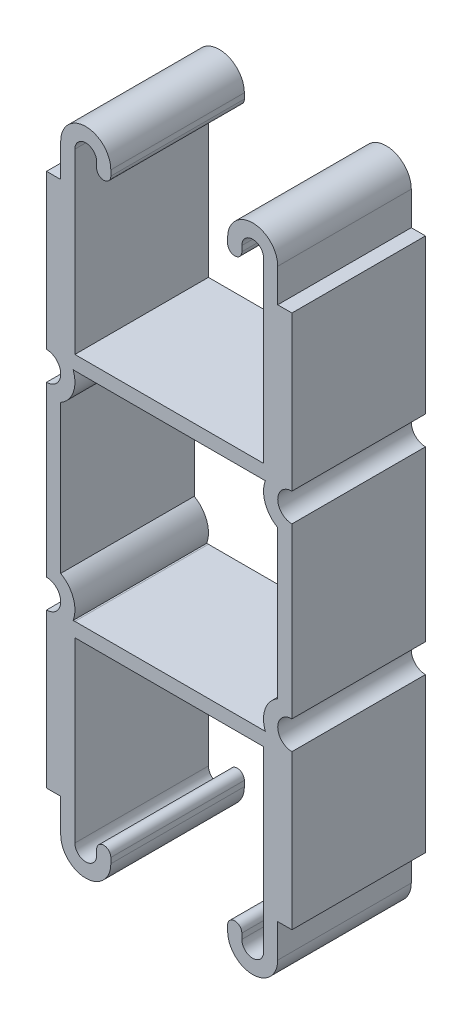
ISO-10303-21;
HEADER;
FILE_DESCRIPTION(('STEP AP214'),'2;1');
FILE_NAME('part.step','',(''),(''),'','','');
FILE_SCHEMA(('AUTOMOTIVE_DESIGN { 1 0 10303 214 1 1 1 1 }'));
ENDSEC;
DATA;
#1=APPLICATION_CONTEXT('core data for automotive mechanical design processes');
#2=APPLICATION_PROTOCOL_DEFINITION('international standard','automotive_design',2000,#1);
#3=PRODUCT_CONTEXT('',#1,'mechanical');
#4=PRODUCT('Part','Part','',(#3));
#5=PRODUCT_RELATED_PRODUCT_CATEGORY('part','',(#4));
#6=PRODUCT_DEFINITION_FORMATION('','',#4);
#7=PRODUCT_DEFINITION_CONTEXT('part definition',#1,'design');
#8=PRODUCT_DEFINITION('design','',#6,#7);
#9=PRODUCT_DEFINITION_SHAPE('','',#8);
#10=(LENGTH_UNIT() NAMED_UNIT(*) SI_UNIT(.MILLI.,.METRE.));
#11=(NAMED_UNIT(*) PLANE_ANGLE_UNIT() SI_UNIT($,.RADIAN.));
#12=(NAMED_UNIT(*) SI_UNIT($,.STERADIAN.) SOLID_ANGLE_UNIT());
#13=UNCERTAINTY_MEASURE_WITH_UNIT(LENGTH_MEASURE(1.E-05),#10,'distance_accuracy_value','');
#14=(GEOMETRIC_REPRESENTATION_CONTEXT(3) GLOBAL_UNCERTAINTY_ASSIGNED_CONTEXT((#13)) GLOBAL_UNIT_ASSIGNED_CONTEXT((#10,
#11,#12)) REPRESENTATION_CONTEXT('',''));
#15=CARTESIAN_POINT('',(0.,0.,0.));
#16=DIRECTION('',(0.,0.,1.));
#17=DIRECTION('',(1.,0.,0.));
#18=AXIS2_PLACEMENT_3D('',#15,#16,#17);
#19=CARTESIAN_POINT('',(-20.6375,57.15,12.7));
#20=DIRECTION('',(1.,0.,0.));
#21=DIRECTION('',(0.,1.,0.));
#22=AXIS2_PLACEMENT_3D('',#19,#20,#21);
#23=PLANE('',#22);
#24=DIRECTION('',(0.,0.,-1.));
#25=VECTOR('',#24,1.);
#26=CARTESIAN_POINT('',(-20.6375,50.8,12.7));
#27=LINE('',#26,#25);
#28=CARTESIAN_POINT('',(-20.6375,50.8,12.7));
#29=VERTEX_POINT('',#28);
#30=CARTESIAN_POINT('',(-20.6375,50.8,-12.7));
#31=VERTEX_POINT('',#30);
#32=EDGE_CURVE('E638',#29,#31,#27,.T.);
#33=ORIENTED_EDGE('',*,*,#32,.F.);
#34=DIRECTION('',(0.,-1.,0.));
#35=VECTOR('',#34,1.);
#36=CARTESIAN_POINT('',(-20.6375,57.15,12.7));
#37=LINE('',#36,#35);
#38=CARTESIAN_POINT('',(-20.6375,57.15,12.7));
#39=VERTEX_POINT('',#38);
#40=EDGE_CURVE('E695',#39,#29,#37,.T.);
#41=ORIENTED_EDGE('',*,*,#40,.F.);
#42=DIRECTION('',(0.,0.,-1.));
#43=VECTOR('',#42,1.);
#44=CARTESIAN_POINT('',(-20.6375,57.15,12.7));
#45=LINE('',#44,#43);
#46=CARTESIAN_POINT('',(-20.6375,57.15,-12.7));
#47=VERTEX_POINT('',#46);
#48=EDGE_CURVE('E809',#39,#47,#45,.T.);
#49=ORIENTED_EDGE('',*,*,#48,.T.);
#50=DIRECTION('',(0.,-1.,0.));
#51=VECTOR('',#50,1.);
#52=CARTESIAN_POINT('',(-20.6375,57.15,-12.7));
#53=LINE('',#52,#51);
#54=EDGE_CURVE('E732',#47,#31,#53,.T.);
#55=ORIENTED_EDGE('',*,*,#54,.T.);
#56=EDGE_LOOP('',(#33,#41,#49,#55));
#57=FACE_BOUND('',#56,.T.);
#58=ADVANCED_FACE('F33',(#57),#23,.F.);
#59=CARTESIAN_POINT('',(-17.9451,23.3299,12.7));
#60=DIRECTION('',(0.,0.,-1.));
#61=DIRECTION('',(-1.,0.,0.));
#62=AXIS2_PLACEMENT_3D('',#59,#60,#61);
#63=CYLINDRICAL_SURFACE('',#62,2.6924);
#64=DIRECTION('',(0.,0.,-1.));
#65=VECTOR('',#64,1.);
#66=CARTESIAN_POINT('',(-18.2831396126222,20.6588052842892,0.));
#67=LINE('',#66,#65);
#68=CARTESIAN_POINT('',(-18.2831396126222,20.6588052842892,-12.7));
#69=VERTEX_POINT('',#68);
#70=CARTESIAN_POINT('',(-18.2831396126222,20.6588052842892,12.7));
#71=VERTEX_POINT('',#70);
#72=EDGE_CURVE('E688',#69,#71,#67,.F.);
#73=ORIENTED_EDGE('',*,*,#72,.F.);
#74=CARTESIAN_POINT('',(-17.9451,23.3299,-12.7));
#75=DIRECTION('',(0.,0.,1.));
#76=DIRECTION('',(-1.,0.,0.));
#77=AXIS2_PLACEMENT_3D('',#74,#75,#76);
#78=CIRCLE('',#77,2.6924);
#79=CARTESIAN_POINT('',(-17.9451,20.6375,-12.7));
#80=VERTEX_POINT('',#79);
#81=EDGE_CURVE('E734',#69,#80,#78,.T.);
#82=ORIENTED_EDGE('',*,*,#81,.T.);
#83=DIRECTION('',(0.,0.,-1.));
#84=VECTOR('',#83,1.);
#85=CARTESIAN_POINT('',(-17.9451,20.6375,12.7));
#86=LINE('',#85,#84);
#87=CARTESIAN_POINT('',(-17.9451,20.6375,12.7));
#88=VERTEX_POINT('',#87);
#89=EDGE_CURVE('E806',#88,#80,#86,.T.);
#90=ORIENTED_EDGE('',*,*,#89,.F.);
#91=CARTESIAN_POINT('',(-17.9451,23.3299,12.7));
#92=DIRECTION('',(0.,0.,1.));
#93=DIRECTION('',(-1.,0.,0.));
#94=AXIS2_PLACEMENT_3D('',#91,#92,#93);
#95=CIRCLE('',#94,2.6924);
#96=EDGE_CURVE('E699',#71,#88,#95,.T.);
#97=ORIENTED_EDGE('',*,*,#96,.F.);
#98=EDGE_LOOP('',(#73,#82,#90,#97));
#99=FACE_BOUND('',#98,.T.);
#100=ADVANCED_FACE('F858',(#99),#63,.T.);
#101=CARTESIAN_POINT('',(-15.875,57.15,12.7));
#102=DIRECTION('',(0.,0.,-1.));
#103=DIRECTION('',(-1.,0.,0.));
#104=AXIS2_PLACEMENT_3D('',#101,#102,#103);
#105=CYLINDRICAL_SURFACE('',#104,4.7625);
#106=CARTESIAN_POINT('',(-15.875,57.15,-12.7));
#107=DIRECTION('',(0.,0.,1.));
#108=DIRECTION('',(-1.,0.,0.));
#109=AXIS2_PLACEMENT_3D('',#106,#107,#108);
#110=CIRCLE('',#109,4.7625);
#111=CARTESIAN_POINT('',(-11.1125,57.15,-12.7));
#112=VERTEX_POINT('',#111);
#113=EDGE_CURVE('E691',#112,#47,#110,.T.);
#114=ORIENTED_EDGE('',*,*,#113,.T.);
#115=ORIENTED_EDGE('',*,*,#48,.F.);
#116=CARTESIAN_POINT('',(-15.875,57.15,12.7));
#117=DIRECTION('',(0.,0.,1.));
#118=DIRECTION('',(-1.,0.,0.));
#119=AXIS2_PLACEMENT_3D('',#116,#117,#118);
#120=CIRCLE('',#119,4.7625);
#121=CARTESIAN_POINT('',(-11.1125,57.15,12.7));
#122=VERTEX_POINT('',#121);
#123=EDGE_CURVE('E692',#122,#39,#120,.T.);
#124=ORIENTED_EDGE('',*,*,#123,.F.);
#125=DIRECTION('',(0.,0.,-1.));
#126=VECTOR('',#125,1.);
#127=CARTESIAN_POINT('',(-11.1125,57.15,12.7));
#128=LINE('',#127,#126);
#129=EDGE_CURVE('E729',#122,#112,#128,.T.);
#130=ORIENTED_EDGE('',*,*,#129,.T.);
#131=EDGE_LOOP('',(#114,#115,#124,#130));
#132=FACE_BOUND('',#131,.T.);
#133=ADVANCED_FACE('F35',(#132),#105,.T.);
#134=CARTESIAN_POINT('',(-17.9451,20.6375,12.7));
#135=DIRECTION('',(0.,1.,0.));
#136=DIRECTION('',(0.,0.,1.));
#137=AXIS2_PLACEMENT_3D('',#134,#135,#136);
#138=PLANE('',#137);
#139=DIRECTION('',(1.,0.,0.));
#140=VECTOR('',#139,1.);
#141=CARTESIAN_POINT('',(-17.9451,20.6375,-12.7));
#142=LINE('',#141,#140);
#143=CARTESIAN_POINT('',(17.9451,20.6375,-12.7));
#144=VERTEX_POINT('',#143);
#145=EDGE_CURVE('E736',#80,#144,#142,.T.);
#146=ORIENTED_EDGE('',*,*,#145,.T.);
#147=DIRECTION('',(0.,0.,-1.));
#148=VECTOR('',#147,1.);
#149=CARTESIAN_POINT('',(17.9451,20.6375,12.7));
#150=LINE('',#149,#148);
#151=CARTESIAN_POINT('',(17.9451,20.6375,12.7));
#152=VERTEX_POINT('',#151);
#153=EDGE_CURVE('E803',#152,#144,#150,.T.);
#154=ORIENTED_EDGE('',*,*,#153,.F.);
#155=DIRECTION('',(1.,0.,0.));
#156=VECTOR('',#155,1.);
#157=CARTESIAN_POINT('',(-17.9451,20.6375,12.7));
#158=LINE('',#157,#156);
#159=EDGE_CURVE('E701',#88,#152,#158,.T.);
#160=ORIENTED_EDGE('',*,*,#159,.F.);
#161=ORIENTED_EDGE('',*,*,#89,.T.);
#162=EDGE_LOOP('',(#146,#154,#160,#161));
#163=FACE_BOUND('',#162,.T.);
#164=ADVANCED_FACE('F866',(#163),#138,.F.);
#165=CARTESIAN_POINT('',(17.9451,23.3299,12.7));
#166=DIRECTION('',(0.,0.,-1.));
#167=DIRECTION('',(-1.,0.,0.));
#168=AXIS2_PLACEMENT_3D('',#165,#166,#167);
#169=CYLINDRICAL_SURFACE('',#168,2.6924);
#170=CARTESIAN_POINT('',(17.9451,23.3299,-12.7));
#171=DIRECTION('',(0.,0.,1.));
#172=DIRECTION('',(1.,0.,0.));
#173=AXIS2_PLACEMENT_3D('',#170,#171,#172);
#174=CIRCLE('',#173,2.6924);
#175=CARTESIAN_POINT('',(18.2831396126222,20.6588052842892,-12.7));
#176=VERTEX_POINT('',#175);
#177=EDGE_CURVE('E738',#144,#176,#174,.T.);
#178=ORIENTED_EDGE('',*,*,#177,.T.);
#179=DIRECTION('',(0.,0.,-1.));
#180=VECTOR('',#179,1.);
#181=CARTESIAN_POINT('',(18.2831396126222,20.6588052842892,0.));
#182=LINE('',#181,#180);
#183=CARTESIAN_POINT('',(18.2831396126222,20.6588052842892,12.7));
#184=VERTEX_POINT('',#183);
#185=EDGE_CURVE('E56',#176,#184,#182,.F.);
#186=ORIENTED_EDGE('',*,*,#185,.T.);
#187=CARTESIAN_POINT('',(17.9451,23.3299,12.7));
#188=DIRECTION('',(0.,0.,1.));
#189=DIRECTION('',(1.,0.,0.));
#190=AXIS2_PLACEMENT_3D('',#187,#188,#189);
#191=CIRCLE('',#190,2.6924);
#192=EDGE_CURVE('E405',#152,#184,#191,.T.);
#193=ORIENTED_EDGE('',*,*,#192,.F.);
#194=ORIENTED_EDGE('',*,*,#153,.T.);
#195=EDGE_LOOP('',(#178,#186,#193,#194));
#196=FACE_BOUND('',#195,.T.);
#197=ADVANCED_FACE('F869',(#196),#169,.T.);
#198=CARTESIAN_POINT('',(20.6375,23.3299,12.7));
#199=DIRECTION('',(-1.,0.,0.));
#200=DIRECTION('',(0.,-1.,0.));
#201=AXIS2_PLACEMENT_3D('',#198,#199,#200);
#202=PLANE('',#201);
#203=DIRECTION('',(0.,1.,0.));
#204=VECTOR('',#203,1.);
#205=CARTESIAN_POINT('',(20.6375,23.3299,12.7));
#206=LINE('',#205,#204);
#207=CARTESIAN_POINT('',(20.6375,50.8,12.7));
#208=VERTEX_POINT('',#207);
#209=CARTESIAN_POINT('',(20.6375,57.15,12.7));
#210=VERTEX_POINT('',#209);
#211=EDGE_CURVE('E48',#208,#210,#206,.T.);
#212=ORIENTED_EDGE('',*,*,#211,.F.);
#213=DIRECTION('',(0.,0.,-1.));
#214=VECTOR('',#213,1.);
#215=CARTESIAN_POINT('',(20.6375,50.8,12.7));
#216=LINE('',#215,#214);
#217=CARTESIAN_POINT('',(20.6375,50.8,-12.7));
#218=VERTEX_POINT('',#217);
#219=EDGE_CURVE('E397',#208,#218,#216,.T.);
#220=ORIENTED_EDGE('',*,*,#219,.T.);
#221=DIRECTION('',(0.,1.,0.));
#222=VECTOR('',#221,1.);
#223=CARTESIAN_POINT('',(20.6375,23.3299,-12.7));
#224=LINE('',#223,#222);
#225=CARTESIAN_POINT('',(20.6375,57.15,-12.7));
#226=VERTEX_POINT('',#225);
#227=EDGE_CURVE('E740',#218,#226,#224,.T.);
#228=ORIENTED_EDGE('',*,*,#227,.T.);
#229=DIRECTION('',(0.,0.,-1.));
#230=VECTOR('',#229,1.);
#231=CARTESIAN_POINT('',(20.6375,57.15,12.7));
#232=LINE('',#231,#230);
#233=EDGE_CURVE('E800',#210,#226,#232,.T.);
#234=ORIENTED_EDGE('',*,*,#233,.F.);
#235=EDGE_LOOP('',(#212,#220,#228,#234));
#236=FACE_BOUND('',#235,.T.);
#237=ADVANCED_FACE('F873',(#236),#202,.F.);
#238=CARTESIAN_POINT('',(15.875,57.15,12.7));
#239=DIRECTION('',(0.,0.,-1.));
#240=DIRECTION('',(-1.,0.,0.));
#241=AXIS2_PLACEMENT_3D('',#238,#239,#240);
#242=CYLINDRICAL_SURFACE('',#241,4.7625);
#243=CARTESIAN_POINT('',(15.875,57.15,-12.7));
#244=DIRECTION('',(0.,0.,1.));
#245=DIRECTION('',(1.,0.,0.));
#246=AXIS2_PLACEMENT_3D('',#243,#244,#245);
#247=CIRCLE('',#246,4.7625);
#248=CARTESIAN_POINT('',(11.1125,57.15,-12.7));
#249=VERTEX_POINT('',#248);
#250=EDGE_CURVE('E742',#226,#249,#247,.T.);
#251=ORIENTED_EDGE('',*,*,#250,.T.);
#252=DIRECTION('',(0.,0.,-1.));
#253=VECTOR('',#252,1.);
#254=CARTESIAN_POINT('',(11.1125,57.15,12.7));
#255=LINE('',#254,#253);
#256=CARTESIAN_POINT('',(11.1125,57.15,12.7));
#257=VERTEX_POINT('',#256);
#258=EDGE_CURVE('E797',#257,#249,#255,.T.);
#259=ORIENTED_EDGE('',*,*,#258,.F.);
#260=CARTESIAN_POINT('',(15.875,57.15,12.7));
#261=DIRECTION('',(0.,0.,1.));
#262=DIRECTION('',(1.,0.,0.));
#263=AXIS2_PLACEMENT_3D('',#260,#261,#262);
#264=CIRCLE('',#263,4.7625);
#265=EDGE_CURVE('E705',#210,#257,#264,.T.);
#266=ORIENTED_EDGE('',*,*,#265,.F.);
#267=ORIENTED_EDGE('',*,*,#233,.T.);
#268=EDGE_LOOP('',(#251,#259,#266,#267));
#269=FACE_BOUND('',#268,.T.);
#270=ADVANCED_FACE('F876',(#269),#242,.T.);
#271=CARTESIAN_POINT('',(11.1125,57.15,12.7));
#272=DIRECTION('',(1.,0.,0.));
#273=DIRECTION('',(0.,1.,0.));
#274=AXIS2_PLACEMENT_3D('',#271,#272,#273);
#275=PLANE('',#274);
#276=DIRECTION('',(0.,-1.,0.));
#277=VECTOR('',#276,1.);
#278=CARTESIAN_POINT('',(11.1125,57.15,-12.7));
#279=LINE('',#278,#277);
#280=CARTESIAN_POINT('',(11.1125,56.11495,-12.7));
#281=VERTEX_POINT('',#280);
#282=EDGE_CURVE('E744',#249,#281,#279,.T.);
#283=ORIENTED_EDGE('',*,*,#282,.T.);
#284=DIRECTION('',(0.,0.,-1.));
#285=VECTOR('',#284,1.);
#286=CARTESIAN_POINT('',(11.1125,56.11495,12.7));
#287=LINE('',#286,#285);
#288=CARTESIAN_POINT('',(11.1125,56.11495,12.7));
#289=VERTEX_POINT('',#288);
#290=EDGE_CURVE('E794',#289,#281,#287,.T.);
#291=ORIENTED_EDGE('',*,*,#290,.F.);
#292=DIRECTION('',(0.,-1.,0.));
#293=VECTOR('',#292,1.);
#294=CARTESIAN_POINT('',(11.1125,57.15,12.7));
#295=LINE('',#294,#293);
#296=EDGE_CURVE('E707',#257,#289,#295,.T.);
#297=ORIENTED_EDGE('',*,*,#296,.F.);
#298=ORIENTED_EDGE('',*,*,#258,.T.);
#299=EDGE_LOOP('',(#283,#291,#297,#298));
#300=FACE_BOUND('',#299,.T.);
#301=ADVANCED_FACE('F879',(#300),#275,.F.);
#302=CARTESIAN_POINT('',(12.4587,56.11495,12.7));
#303=DIRECTION('',(0.,0.,-1.));
#304=DIRECTION('',(-1.,0.,0.));
#305=AXIS2_PLACEMENT_3D('',#302,#303,#304);
#306=CYLINDRICAL_SURFACE('',#305,1.3462);
#307=CARTESIAN_POINT('',(12.4587,56.11495,-12.7));
#308=DIRECTION('',(0.,0.,1.));
#309=DIRECTION('',(1.,0.,0.));
#310=AXIS2_PLACEMENT_3D('',#307,#308,#309);
#311=CIRCLE('',#310,1.3462);
#312=CARTESIAN_POINT('',(13.8049,56.11495,-12.7));
#313=VERTEX_POINT('',#312);
#314=EDGE_CURVE('E746',#281,#313,#311,.T.);
#315=ORIENTED_EDGE('',*,*,#314,.T.);
#316=DIRECTION('',(0.,0.,-1.));
#317=VECTOR('',#316,1.);
#318=CARTESIAN_POINT('',(13.8049,56.11495,12.7));
#319=LINE('',#318,#317);
#320=CARTESIAN_POINT('',(13.8049,56.11495,12.7));
#321=VERTEX_POINT('',#320);
#322=EDGE_CURVE('E791',#321,#313,#319,.T.);
#323=ORIENTED_EDGE('',*,*,#322,.F.);
#324=CARTESIAN_POINT('',(12.4587,56.11495,12.7));
#325=DIRECTION('',(0.,0.,1.));
#326=DIRECTION('',(1.,0.,0.));
#327=AXIS2_PLACEMENT_3D('',#324,#325,#326);
#328=CIRCLE('',#327,1.3462);
#329=EDGE_CURVE('E709',#289,#321,#328,.T.);
#330=ORIENTED_EDGE('',*,*,#329,.F.);
#331=ORIENTED_EDGE('',*,*,#290,.T.);
#332=EDGE_LOOP('',(#315,#323,#330,#331));
#333=FACE_BOUND('',#332,.T.);
#334=ADVANCED_FACE('F883',(#333),#306,.T.);
#335=CARTESIAN_POINT('',(13.8049,57.15,12.7));
#336=DIRECTION('',(-1.,0.,0.));
#337=DIRECTION('',(0.,-1.,0.));
#338=AXIS2_PLACEMENT_3D('',#335,#336,#337);
#339=PLANE('',#338);
#340=DIRECTION('',(0.,1.,0.));
#341=VECTOR('',#340,1.);
#342=CARTESIAN_POINT('',(13.8049,57.15,-12.7));
#343=LINE('',#342,#341);
#344=CARTESIAN_POINT('',(13.8049,57.15,-12.7));
#345=VERTEX_POINT('',#344);
#346=EDGE_CURVE('E748',#313,#345,#343,.T.);
#347=ORIENTED_EDGE('',*,*,#346,.T.);
#348=DIRECTION('',(0.,0.,-1.));
#349=VECTOR('',#348,1.);
#350=CARTESIAN_POINT('',(13.8049,57.15,12.7));
#351=LINE('',#350,#349);
#352=CARTESIAN_POINT('',(13.8049,57.15,12.7));
#353=VERTEX_POINT('',#352);
#354=EDGE_CURVE('E788',#353,#345,#351,.T.);
#355=ORIENTED_EDGE('',*,*,#354,.F.);
#356=DIRECTION('',(0.,1.,0.));
#357=VECTOR('',#356,1.);
#358=CARTESIAN_POINT('',(13.8049,57.15,12.7));
#359=LINE('',#358,#357);
#360=EDGE_CURVE('E711',#321,#353,#359,.T.);
#361=ORIENTED_EDGE('',*,*,#360,.F.);
#362=ORIENTED_EDGE('',*,*,#322,.T.);
#363=EDGE_LOOP('',(#347,#355,#361,#362));
#364=FACE_BOUND('',#363,.T.);
#365=ADVANCED_FACE('F887',(#364),#339,.F.);
#366=CARTESIAN_POINT('',(15.875,57.15,12.7));
#367=DIRECTION('',(0.,0.,-1.));
#368=DIRECTION('',(-1.,0.,0.));
#369=AXIS2_PLACEMENT_3D('',#366,#367,#368);
#370=CYLINDRICAL_SURFACE('',#369,2.0701);
#371=CARTESIAN_POINT('',(15.875,57.15,-12.7));
#372=DIRECTION('',(0.,0.,-1.));
#373=DIRECTION('',(1.,0.,0.));
#374=AXIS2_PLACEMENT_3D('',#371,#372,#373);
#375=CIRCLE('',#374,2.0701);
#376=CARTESIAN_POINT('',(17.9451,57.15,-12.7));
#377=VERTEX_POINT('',#376);
#378=EDGE_CURVE('E750',#345,#377,#375,.T.);
#379=ORIENTED_EDGE('',*,*,#378,.T.);
#380=DIRECTION('',(0.,0.,-1.));
#381=VECTOR('',#380,1.);
#382=CARTESIAN_POINT('',(17.9451,57.15,12.7));
#383=LINE('',#382,#381);
#384=CARTESIAN_POINT('',(17.9451,57.15,12.7));
#385=VERTEX_POINT('',#384);
#386=EDGE_CURVE('E785',#385,#377,#383,.T.);
#387=ORIENTED_EDGE('',*,*,#386,.F.);
#388=CARTESIAN_POINT('',(15.875,57.15,12.7));
#389=DIRECTION('',(0.,0.,-1.));
#390=DIRECTION('',(1.,0.,0.));
#391=AXIS2_PLACEMENT_3D('',#388,#389,#390);
#392=CIRCLE('',#391,2.0701);
#393=EDGE_CURVE('E713',#353,#385,#392,.T.);
#394=ORIENTED_EDGE('',*,*,#393,.F.);
#395=ORIENTED_EDGE('',*,*,#354,.T.);
#396=EDGE_LOOP('',(#379,#387,#394,#395));
#397=FACE_BOUND('',#396,.T.);
#398=ADVANCED_FACE('F891',(#397),#370,.F.);
#399=CARTESIAN_POINT('',(17.9451,23.3299,12.7));
#400=DIRECTION('',(1.,0.,0.));
#401=DIRECTION('',(0.,0.,-1.));
#402=AXIS2_PLACEMENT_3D('',#399,#400,#401);
#403=PLANE('',#402);
#404=DIRECTION('',(0.,-1.,0.));
#405=VECTOR('',#404,1.);
#406=CARTESIAN_POINT('',(17.9451,23.3299,-12.7));
#407=LINE('',#406,#405);
#408=CARTESIAN_POINT('',(17.9451,23.3299,-12.7));
#409=VERTEX_POINT('',#408);
#410=EDGE_CURVE('E752',#377,#409,#407,.T.);
#411=ORIENTED_EDGE('',*,*,#410,.T.);
#412=DIRECTION('',(0.,0.,-1.));
#413=VECTOR('',#412,1.);
#414=CARTESIAN_POINT('',(17.9451,23.3299,12.7));
#415=LINE('',#414,#413);
#416=CARTESIAN_POINT('',(17.9451,23.3299,12.7));
#417=VERTEX_POINT('',#416);
#418=EDGE_CURVE('E782',#417,#409,#415,.T.);
#419=ORIENTED_EDGE('',*,*,#418,.F.);
#420=DIRECTION('',(0.,-1.,0.));
#421=VECTOR('',#420,1.);
#422=CARTESIAN_POINT('',(17.9451,23.3299,12.7));
#423=LINE('',#422,#421);
#424=EDGE_CURVE('E715',#385,#417,#423,.T.);
#425=ORIENTED_EDGE('',*,*,#424,.F.);
#426=ORIENTED_EDGE('',*,*,#386,.T.);
#427=EDGE_LOOP('',(#411,#419,#425,#426));
#428=FACE_BOUND('',#427,.T.);
#429=ADVANCED_FACE('F895',(#428),#403,.F.);
#430=CARTESIAN_POINT('',(-17.9451,23.3299,12.7));
#431=DIRECTION('',(0.,-1.,0.));
#432=DIRECTION('',(0.,0.,-1.));
#433=AXIS2_PLACEMENT_3D('',#430,#431,#432);
#434=PLANE('',#433);
#435=DIRECTION('',(-1.,0.,0.));
#436=VECTOR('',#435,1.);
#437=CARTESIAN_POINT('',(-17.9451,23.3299,-12.7));
#438=LINE('',#437,#436);
#439=CARTESIAN_POINT('',(-17.9451,23.3299,-12.7));
#440=VERTEX_POINT('',#439);
#441=EDGE_CURVE('E754',#409,#440,#438,.T.);
#442=ORIENTED_EDGE('',*,*,#441,.T.);
#443=DIRECTION('',(0.,0.,-1.));
#444=VECTOR('',#443,1.);
#445=CARTESIAN_POINT('',(-17.9451,23.3299,12.7));
#446=LINE('',#445,#444);
#447=CARTESIAN_POINT('',(-17.9451,23.3299,12.7));
#448=VERTEX_POINT('',#447);
#449=EDGE_CURVE('E779',#448,#440,#446,.T.);
#450=ORIENTED_EDGE('',*,*,#449,.F.);
#451=DIRECTION('',(-1.,0.,0.));
#452=VECTOR('',#451,1.);
#453=CARTESIAN_POINT('',(-17.9451,23.3299,12.7));
#454=LINE('',#453,#452);
#455=EDGE_CURVE('E717',#417,#448,#454,.T.);
#456=ORIENTED_EDGE('',*,*,#455,.F.);
#457=ORIENTED_EDGE('',*,*,#418,.T.);
#458=EDGE_LOOP('',(#442,#450,#456,#457));
#459=FACE_BOUND('',#458,.T.);
#460=ADVANCED_FACE('F899',(#459),#434,.F.);
#461=CARTESIAN_POINT('',(-17.9451,57.15,12.7));
#462=DIRECTION('',(-1.,0.,0.));
#463=DIRECTION('',(0.,-1.,0.));
#464=AXIS2_PLACEMENT_3D('',#461,#462,#463);
#465=PLANE('',#464);
#466=DIRECTION('',(0.,1.,0.));
#467=VECTOR('',#466,1.);
#468=CARTESIAN_POINT('',(-17.9451,57.15,-12.7));
#469=LINE('',#468,#467);
#470=CARTESIAN_POINT('',(-17.9451,57.15,-12.7));
#471=VERTEX_POINT('',#470);
#472=EDGE_CURVE('E756',#440,#471,#469,.T.);
#473=ORIENTED_EDGE('',*,*,#472,.T.);
#474=DIRECTION('',(0.,0.,-1.));
#475=VECTOR('',#474,1.);
#476=CARTESIAN_POINT('',(-17.9451,57.15,12.7));
#477=LINE('',#476,#475);
#478=CARTESIAN_POINT('',(-17.9451,57.15,12.7));
#479=VERTEX_POINT('',#478);
#480=EDGE_CURVE('E776',#479,#471,#477,.T.);
#481=ORIENTED_EDGE('',*,*,#480,.F.);
#482=DIRECTION('',(0.,1.,0.));
#483=VECTOR('',#482,1.);
#484=CARTESIAN_POINT('',(-17.9451,57.15,12.7));
#485=LINE('',#484,#483);
#486=EDGE_CURVE('E719',#448,#479,#485,.T.);
#487=ORIENTED_EDGE('',*,*,#486,.F.);
#488=ORIENTED_EDGE('',*,*,#449,.T.);
#489=EDGE_LOOP('',(#473,#481,#487,#488));
#490=FACE_BOUND('',#489,.T.);
#491=ADVANCED_FACE('F903',(#490),#465,.F.);
#492=CARTESIAN_POINT('',(-15.875,57.15,12.7));
#493=DIRECTION('',(0.,0.,-1.));
#494=DIRECTION('',(-1.,0.,0.));
#495=AXIS2_PLACEMENT_3D('',#492,#493,#494);
#496=CYLINDRICAL_SURFACE('',#495,2.0701);
#497=CARTESIAN_POINT('',(-15.875,57.15,-12.7));
#498=DIRECTION('',(0.,0.,-1.));
#499=DIRECTION('',(-1.,0.,0.));
#500=AXIS2_PLACEMENT_3D('',#497,#498,#499);
#501=CIRCLE('',#500,2.0701);
#502=CARTESIAN_POINT('',(-13.8049,57.15,-12.7));
#503=VERTEX_POINT('',#502);
#504=EDGE_CURVE('E758',#471,#503,#501,.T.);
#505=ORIENTED_EDGE('',*,*,#504,.T.);
#506=DIRECTION('',(0.,0.,-1.));
#507=VECTOR('',#506,1.);
#508=CARTESIAN_POINT('',(-13.8049,57.15,12.7));
#509=LINE('',#508,#507);
#510=CARTESIAN_POINT('',(-13.8049,57.15,12.7));
#511=VERTEX_POINT('',#510);
#512=EDGE_CURVE('E773',#511,#503,#509,.T.);
#513=ORIENTED_EDGE('',*,*,#512,.F.);
#514=CARTESIAN_POINT('',(-15.875,57.15,12.7));
#515=DIRECTION('',(0.,0.,-1.));
#516=DIRECTION('',(-1.,0.,0.));
#517=AXIS2_PLACEMENT_3D('',#514,#515,#516);
#518=CIRCLE('',#517,2.0701);
#519=EDGE_CURVE('E721',#479,#511,#518,.T.);
#520=ORIENTED_EDGE('',*,*,#519,.F.);
#521=ORIENTED_EDGE('',*,*,#480,.T.);
#522=EDGE_LOOP('',(#505,#513,#520,#521));
#523=FACE_BOUND('',#522,.T.);
#524=ADVANCED_FACE('F907',(#523),#496,.F.);
#525=CARTESIAN_POINT('',(-13.8049,57.15,12.7));
#526=DIRECTION('',(1.,0.,0.));
#527=DIRECTION('',(0.,0.,-1.));
#528=AXIS2_PLACEMENT_3D('',#525,#526,#527);
#529=PLANE('',#528);
#530=DIRECTION('',(0.,-1.,0.));
#531=VECTOR('',#530,1.);
#532=CARTESIAN_POINT('',(-13.8049,57.15,-12.7));
#533=LINE('',#532,#531);
#534=CARTESIAN_POINT('',(-13.8049,56.11495,-12.7));
#535=VERTEX_POINT('',#534);
#536=EDGE_CURVE('E760',#503,#535,#533,.T.);
#537=ORIENTED_EDGE('',*,*,#536,.T.);
#538=DIRECTION('',(0.,0.,-1.));
#539=VECTOR('',#538,1.);
#540=CARTESIAN_POINT('',(-13.8049,56.11495,12.7));
#541=LINE('',#540,#539);
#542=CARTESIAN_POINT('',(-13.8049,56.11495,12.7));
#543=VERTEX_POINT('',#542);
#544=EDGE_CURVE('E770',#543,#535,#541,.T.);
#545=ORIENTED_EDGE('',*,*,#544,.F.);
#546=DIRECTION('',(0.,-1.,0.));
#547=VECTOR('',#546,1.);
#548=CARTESIAN_POINT('',(-13.8049,57.15,12.7));
#549=LINE('',#548,#547);
#550=EDGE_CURVE('E723',#511,#543,#549,.T.);
#551=ORIENTED_EDGE('',*,*,#550,.F.);
#552=ORIENTED_EDGE('',*,*,#512,.T.);
#553=EDGE_LOOP('',(#537,#545,#551,#552));
#554=FACE_BOUND('',#553,.T.);
#555=ADVANCED_FACE('F911',(#554),#529,.F.);
#556=CARTESIAN_POINT('',(-12.4587,56.11495,12.7));
#557=DIRECTION('',(0.,0.,-1.));
#558=DIRECTION('',(-1.,0.,0.));
#559=AXIS2_PLACEMENT_3D('',#556,#557,#558);
#560=CYLINDRICAL_SURFACE('',#559,1.3462);
#561=CARTESIAN_POINT('',(-12.4587,56.11495,-12.7));
#562=DIRECTION('',(0.,0.,1.));
#563=DIRECTION('',(-1.,0.,0.));
#564=AXIS2_PLACEMENT_3D('',#561,#562,#563);
#565=CIRCLE('',#564,1.3462);
#566=CARTESIAN_POINT('',(-11.1125,56.11495,-12.7));
#567=VERTEX_POINT('',#566);
#568=EDGE_CURVE('E762',#535,#567,#565,.T.);
#569=ORIENTED_EDGE('',*,*,#568,.T.);
#570=DIRECTION('',(0.,0.,-1.));
#571=VECTOR('',#570,1.);
#572=CARTESIAN_POINT('',(-11.1125,56.11495,12.7));
#573=LINE('',#572,#571);
#574=CARTESIAN_POINT('',(-11.1125,56.11495,12.7));
#575=VERTEX_POINT('',#574);
#576=EDGE_CURVE('E767',#575,#567,#573,.T.);
#577=ORIENTED_EDGE('',*,*,#576,.F.);
#578=CARTESIAN_POINT('',(-12.4587,56.11495,12.7));
#579=DIRECTION('',(0.,0.,1.));
#580=DIRECTION('',(-1.,0.,0.));
#581=AXIS2_PLACEMENT_3D('',#578,#579,#580);
#582=CIRCLE('',#581,1.3462);
#583=EDGE_CURVE('E725',#543,#575,#582,.T.);
#584=ORIENTED_EDGE('',*,*,#583,.F.);
#585=ORIENTED_EDGE('',*,*,#544,.T.);
#586=EDGE_LOOP('',(#569,#577,#584,#585));
#587=FACE_BOUND('',#586,.T.);
#588=ADVANCED_FACE('F915',(#587),#560,.T.);
#589=CARTESIAN_POINT('',(-11.1125,57.15,12.7));
#590=DIRECTION('',(-1.,0.,0.));
#591=DIRECTION('',(0.,0.,1.));
#592=AXIS2_PLACEMENT_3D('',#589,#590,#591);
#593=PLANE('',#592);
#594=DIRECTION('',(0.,1.,0.));
#595=VECTOR('',#594,1.);
#596=CARTESIAN_POINT('',(-11.1125,57.15,-12.7));
#597=LINE('',#596,#595);
#598=EDGE_CURVE('E696',#567,#112,#597,.T.);
#599=ORIENTED_EDGE('',*,*,#598,.T.);
#600=ORIENTED_EDGE('',*,*,#129,.F.);
#601=DIRECTION('',(0.,1.,0.));
#602=VECTOR('',#601,1.);
#603=CARTESIAN_POINT('',(-11.1125,57.15,12.7));
#604=LINE('',#603,#602);
#605=EDGE_CURVE('E727',#575,#122,#604,.T.);
#606=ORIENTED_EDGE('',*,*,#605,.F.);
#607=ORIENTED_EDGE('',*,*,#576,.T.);
#608=EDGE_LOOP('',(#599,#600,#606,#607));
#609=FACE_BOUND('',#608,.T.);
#610=ADVANCED_FACE('F919',(#609),#593,.F.);
#611=CARTESIAN_POINT('',(-15.875,57.15,12.7));
#612=DIRECTION('',(0.,0.,-1.));
#613=DIRECTION('',(-1.,0.,0.));
#614=AXIS2_PLACEMENT_3D('',#611,#612,#613);
#615=PLANE('',#614);
#616=DIRECTION('',(1.,0.,0.));
#617=VECTOR('',#616,1.);
#618=CARTESIAN_POINT('',(23.3374999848,50.8,12.7));
#619=LINE('',#618,#617);
#620=CARTESIAN_POINT('',(23.3374999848,50.8,12.7));
#621=VERTEX_POINT('',#620);
#622=EDGE_CURVE('E406',#208,#621,#619,.T.);
#623=ORIENTED_EDGE('',*,*,#622,.F.);
#624=ORIENTED_EDGE('',*,*,#211,.T.);
#625=ORIENTED_EDGE('',*,*,#265,.T.);
#626=ORIENTED_EDGE('',*,*,#296,.T.);
#627=ORIENTED_EDGE('',*,*,#329,.T.);
#628=ORIENTED_EDGE('',*,*,#360,.T.);
#629=ORIENTED_EDGE('',*,*,#393,.T.);
#630=ORIENTED_EDGE('',*,*,#424,.T.);
#631=ORIENTED_EDGE('',*,*,#455,.T.);
#632=ORIENTED_EDGE('',*,*,#486,.T.);
#633=ORIENTED_EDGE('',*,*,#519,.T.);
#634=ORIENTED_EDGE('',*,*,#550,.T.);
#635=ORIENTED_EDGE('',*,*,#583,.T.);
#636=ORIENTED_EDGE('',*,*,#605,.T.);
#637=ORIENTED_EDGE('',*,*,#123,.T.);
#638=ORIENTED_EDGE('',*,*,#40,.T.);
#639=DIRECTION('',(-1.,0.,0.));
#640=VECTOR('',#639,1.);
#641=CARTESIAN_POINT('',(-23.3374999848,50.8,12.7));
#642=LINE('',#641,#640);
#643=CARTESIAN_POINT('',(-23.3374999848,50.8,12.7));
#644=VERTEX_POINT('',#643);
#645=EDGE_CURVE('E615',#29,#644,#642,.T.);
#646=ORIENTED_EDGE('',*,*,#645,.T.);
#647=DIRECTION('',(0.,-1.,0.));
#648=VECTOR('',#647,1.);
#649=CARTESIAN_POINT('',(-23.3374999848,50.8,12.7));
#650=LINE('',#649,#648);
#651=CARTESIAN_POINT('',(-23.3374999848,21.4578999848,12.7));
#652=VERTEX_POINT('',#651);
#653=EDGE_CURVE('E618',#644,#652,#650,.T.);
#654=ORIENTED_EDGE('',*,*,#653,.T.);
#655=CARTESIAN_POINT('',(-23.3374999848,18.7579,12.7));
#656=DIRECTION('',(0.,0.,-1.));
#657=DIRECTION('',(1.,0.,0.));
#658=AXIS2_PLACEMENT_3D('',#655,#656,#657);
#659=CIRCLE('',#658,2.6999999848);
#660=CARTESIAN_POINT('',(-23.3374999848,16.0579000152,12.7));
#661=VERTEX_POINT('',#660);
#662=EDGE_CURVE('E621',#652,#661,#659,.T.);
#663=ORIENTED_EDGE('',*,*,#662,.T.);
#664=DIRECTION('',(0.,-1.,0.));
#665=VECTOR('',#664,1.);
#666=CARTESIAN_POINT('',(-23.3374999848,16.0579000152,12.7));
#667=LINE('',#666,#665);
#668=CARTESIAN_POINT('',(-23.3374999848,-16.0579000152,12.7));
#669=VERTEX_POINT('',#668);
#670=EDGE_CURVE('E623',#661,#669,#667,.T.);
#671=ORIENTED_EDGE('',*,*,#670,.T.);
#672=CARTESIAN_POINT('',(-23.3374999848,-18.7579,12.7));
#673=DIRECTION('',(0.,0.,-1.));
#674=DIRECTION('',(-1.,0.,0.));
#675=AXIS2_PLACEMENT_3D('',#672,#673,#674);
#676=CIRCLE('',#675,2.6999999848);
#677=CARTESIAN_POINT('',(-23.3374999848,-21.4578999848,12.7));
#678=VERTEX_POINT('',#677);
#679=EDGE_CURVE('E625',#669,#678,#676,.T.);
#680=ORIENTED_EDGE('',*,*,#679,.T.);
#681=DIRECTION('',(0.,-1.,0.));
#682=VECTOR('',#681,1.);
#683=CARTESIAN_POINT('',(-23.3374999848,-21.4578999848,12.7));
#684=LINE('',#683,#682);
#685=CARTESIAN_POINT('',(-23.3374999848,-50.8,12.7));
#686=VERTEX_POINT('',#685);
#687=EDGE_CURVE('E627',#678,#686,#684,.T.);
#688=ORIENTED_EDGE('',*,*,#687,.T.);
#689=DIRECTION('',(1.,0.,0.));
#690=VECTOR('',#689,1.);
#691=CARTESIAN_POINT('',(-23.3374999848,-50.8,12.7));
#692=LINE('',#691,#690);
#693=CARTESIAN_POINT('',(-20.6375,-50.8,12.7));
#694=VERTEX_POINT('',#693);
#695=EDGE_CURVE('E629',#686,#694,#692,.T.);
#696=ORIENTED_EDGE('',*,*,#695,.T.);
#697=DIRECTION('',(0.,1.,0.));
#698=VECTOR('',#697,1.);
#699=CARTESIAN_POINT('',(-20.6375,-57.15,12.7));
#700=LINE('',#699,#698);
#701=CARTESIAN_POINT('',(-20.6375,-57.15,12.7));
#702=VERTEX_POINT('',#701);
#703=EDGE_CURVE('E527',#702,#694,#700,.T.);
#704=ORIENTED_EDGE('',*,*,#703,.F.);
#705=CARTESIAN_POINT('',(-15.875,-57.15,12.7));
#706=DIRECTION('',(0.,0.,-1.));
#707=DIRECTION('',(-1.,0.,0.));
#708=AXIS2_PLACEMENT_3D('',#705,#706,#707);
#709=CIRCLE('',#708,4.7625);
#710=CARTESIAN_POINT('',(-11.1125,-57.15,12.7));
#711=VERTEX_POINT('',#710);
#712=EDGE_CURVE('E477',#711,#702,#709,.T.);
#713=ORIENTED_EDGE('',*,*,#712,.F.);
#714=DIRECTION('',(0.,-1.,0.));
#715=VECTOR('',#714,1.);
#716=CARTESIAN_POINT('',(-11.1125,-57.15,12.7));
#717=LINE('',#716,#715);
#718=CARTESIAN_POINT('',(-11.1125,-56.11495,12.7));
#719=VERTEX_POINT('',#718);
#720=EDGE_CURVE('E480',#719,#711,#717,.T.);
#721=ORIENTED_EDGE('',*,*,#720,.F.);
#722=CARTESIAN_POINT('',(-12.4587,-56.11495,12.7));
#723=DIRECTION('',(0.,0.,-1.));
#724=DIRECTION('',(-1.,0.,0.));
#725=AXIS2_PLACEMENT_3D('',#722,#723,#724);
#726=CIRCLE('',#725,1.3462);
#727=CARTESIAN_POINT('',(-13.8049,-56.11495,12.7));
#728=VERTEX_POINT('',#727);
#729=EDGE_CURVE('E484',#728,#719,#726,.T.);
#730=ORIENTED_EDGE('',*,*,#729,.F.);
#731=DIRECTION('',(0.,1.,0.));
#732=VECTOR('',#731,1.);
#733=CARTESIAN_POINT('',(-13.8049,-57.15,12.7));
#734=LINE('',#733,#732);
#735=CARTESIAN_POINT('',(-13.8049,-57.15,12.7));
#736=VERTEX_POINT('',#735);
#737=EDGE_CURVE('E487',#736,#728,#734,.T.);
#738=ORIENTED_EDGE('',*,*,#737,.F.);
#739=CARTESIAN_POINT('',(-15.875,-57.15,12.7));
#740=DIRECTION('',(0.,0.,1.));
#741=DIRECTION('',(-1.,0.,0.));
#742=AXIS2_PLACEMENT_3D('',#739,#740,#741);
#743=CIRCLE('',#742,2.0701);
#744=CARTESIAN_POINT('',(-17.9451,-57.15,12.7));
#745=VERTEX_POINT('',#744);
#746=EDGE_CURVE('E490',#745,#736,#743,.T.);
#747=ORIENTED_EDGE('',*,*,#746,.F.);
#748=DIRECTION('',(0.,-1.,0.));
#749=VECTOR('',#748,1.);
#750=CARTESIAN_POINT('',(-17.9451,-57.15,12.7));
#751=LINE('',#750,#749);
#752=CARTESIAN_POINT('',(-17.9451,-23.3299,12.7));
#753=VERTEX_POINT('',#752);
#754=EDGE_CURVE('E493',#753,#745,#751,.T.);
#755=ORIENTED_EDGE('',*,*,#754,.F.);
#756=DIRECTION('',(-1.,0.,0.));
#757=VECTOR('',#756,1.);
#758=CARTESIAN_POINT('',(-17.9451,-23.3299,12.7));
#759=LINE('',#758,#757);
#760=CARTESIAN_POINT('',(17.9451,-23.3299,12.7));
#761=VERTEX_POINT('',#760);
#762=EDGE_CURVE('E496',#761,#753,#759,.T.);
#763=ORIENTED_EDGE('',*,*,#762,.F.);
#764=DIRECTION('',(0.,1.,0.));
#765=VECTOR('',#764,1.);
#766=CARTESIAN_POINT('',(17.9451,-23.3299,12.7));
#767=LINE('',#766,#765);
#768=CARTESIAN_POINT('',(17.9451,-57.15,12.7));
#769=VERTEX_POINT('',#768);
#770=EDGE_CURVE('E499',#769,#761,#767,.T.);
#771=ORIENTED_EDGE('',*,*,#770,.F.);
#772=CARTESIAN_POINT('',(15.875,-57.15,12.7));
#773=DIRECTION('',(0.,0.,1.));
#774=DIRECTION('',(1.,0.,0.));
#775=AXIS2_PLACEMENT_3D('',#772,#773,#774);
#776=CIRCLE('',#775,2.0701);
#777=CARTESIAN_POINT('',(13.8049,-57.15,12.7));
#778=VERTEX_POINT('',#777);
#779=EDGE_CURVE('E502',#778,#769,#776,.T.);
#780=ORIENTED_EDGE('',*,*,#779,.F.);
#781=DIRECTION('',(0.,-1.,0.));
#782=VECTOR('',#781,1.);
#783=CARTESIAN_POINT('',(13.8049,-57.15,12.7));
#784=LINE('',#783,#782);
#785=CARTESIAN_POINT('',(13.8049,-56.11495,12.7));
#786=VERTEX_POINT('',#785);
#787=EDGE_CURVE('E505',#786,#778,#784,.T.);
#788=ORIENTED_EDGE('',*,*,#787,.F.);
#789=CARTESIAN_POINT('',(12.4587,-56.11495,12.7));
#790=DIRECTION('',(0.,0.,-1.));
#791=DIRECTION('',(1.,0.,0.));
#792=AXIS2_PLACEMENT_3D('',#789,#790,#791);
#793=CIRCLE('',#792,1.3462);
#794=CARTESIAN_POINT('',(11.1125,-56.11495,12.7));
#795=VERTEX_POINT('',#794);
#796=EDGE_CURVE('E508',#795,#786,#793,.T.);
#797=ORIENTED_EDGE('',*,*,#796,.F.);
#798=DIRECTION('',(0.,1.,0.));
#799=VECTOR('',#798,1.);
#800=CARTESIAN_POINT('',(11.1125,-57.15,12.7));
#801=LINE('',#800,#799);
#802=CARTESIAN_POINT('',(11.1125,-57.15,12.7));
#803=VERTEX_POINT('',#802);
#804=EDGE_CURVE('E511',#803,#795,#801,.T.);
#805=ORIENTED_EDGE('',*,*,#804,.F.);
#806=CARTESIAN_POINT('',(15.875,-57.15,12.7));
#807=DIRECTION('',(0.,0.,-1.));
#808=DIRECTION('',(1.,0.,0.));
#809=AXIS2_PLACEMENT_3D('',#806,#807,#808);
#810=CIRCLE('',#809,4.7625);
#811=CARTESIAN_POINT('',(20.6375,-57.15,12.7));
#812=VERTEX_POINT('',#811);
#813=EDGE_CURVE('E514',#812,#803,#810,.T.);
#814=ORIENTED_EDGE('',*,*,#813,.F.);
#815=DIRECTION('',(0.,-1.,0.));
#816=VECTOR('',#815,1.);
#817=CARTESIAN_POINT('',(20.6375,-23.3299,12.7));
#818=LINE('',#817,#816);
#819=CARTESIAN_POINT('',(20.6375,-50.8,12.7));
#820=VERTEX_POINT('',#819);
#821=EDGE_CURVE('E517',#820,#812,#818,.T.);
#822=ORIENTED_EDGE('',*,*,#821,.F.);
#823=DIRECTION('',(-1.,0.,0.));
#824=VECTOR('',#823,1.);
#825=CARTESIAN_POINT('',(23.3374999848,-50.8,12.7));
#826=LINE('',#825,#824);
#827=CARTESIAN_POINT('',(23.3374999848,-50.8,12.7));
#828=VERTEX_POINT('',#827);
#829=EDGE_CURVE('E413',#828,#820,#826,.T.);
#830=ORIENTED_EDGE('',*,*,#829,.F.);
#831=DIRECTION('',(0.,-1.,0.));
#832=VECTOR('',#831,1.);
#833=CARTESIAN_POINT('',(23.3374999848,-21.4578999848,12.7));
#834=LINE('',#833,#832);
#835=CARTESIAN_POINT('',(23.3374999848,-21.4578999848,12.7));
#836=VERTEX_POINT('',#835);
#837=EDGE_CURVE('E418',#836,#828,#834,.T.);
#838=ORIENTED_EDGE('',*,*,#837,.F.);
#839=CARTESIAN_POINT('',(23.3374999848,-18.7579,12.7));
#840=DIRECTION('',(0.,0.,1.));
#841=DIRECTION('',(1.,0.,0.));
#842=AXIS2_PLACEMENT_3D('',#839,#840,#841);
#843=CIRCLE('',#842,2.6999999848);
#844=CARTESIAN_POINT('',(23.3374999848,-16.0579000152,12.7));
#845=VERTEX_POINT('',#844);
#846=EDGE_CURVE('E421',#845,#836,#843,.T.);
#847=ORIENTED_EDGE('',*,*,#846,.F.);
#848=DIRECTION('',(0.,-1.,0.));
#849=VECTOR('',#848,1.);
#850=CARTESIAN_POINT('',(23.3374999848,16.0579000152,12.7));
#851=LINE('',#850,#849);
#852=CARTESIAN_POINT('',(23.3374999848,16.0579000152,12.7));
#853=VERTEX_POINT('',#852);
#854=EDGE_CURVE('E424',#853,#845,#851,.T.);
#855=ORIENTED_EDGE('',*,*,#854,.F.);
#856=CARTESIAN_POINT('',(23.3374999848,18.7579,12.7));
#857=DIRECTION('',(0.,0.,1.));
#858=DIRECTION('',(-1.,0.,0.));
#859=AXIS2_PLACEMENT_3D('',#856,#857,#858);
#860=CIRCLE('',#859,2.6999999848);
#861=CARTESIAN_POINT('',(23.3374999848,21.4578999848,12.7));
#862=VERTEX_POINT('',#861);
#863=EDGE_CURVE('E427',#862,#853,#860,.T.);
#864=ORIENTED_EDGE('',*,*,#863,.F.);
#865=DIRECTION('',(0.,-1.,0.));
#866=VECTOR('',#865,1.);
#867=CARTESIAN_POINT('',(23.3374999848,50.8,12.7));
#868=LINE('',#867,#866);
#869=EDGE_CURVE('E430',#621,#862,#868,.T.);
#870=ORIENTED_EDGE('',*,*,#869,.F.);
#871=EDGE_LOOP('',(#623,#624,#625,#626,#627,#628,#629,#630,#631,#632,#633,#634,#635,#636,#637,
#638,#646,#654,#663,#671,#680,#688,#696,#704,#713,#721,#730,#738,#747,#755,#763,#771,#780,#788,
#797,#805,#814,#822,#830,#838,#847,#855,#864,#870));
#872=FACE_BOUND('',#871,.T.);
#873=CARTESIAN_POINT('',(23.3374999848,-18.7579,12.7));
#874=DIRECTION('',(0.,0.,-1.));
#875=DIRECTION('',(1.,0.,0.));
#876=AXIS2_PLACEMENT_3D('',#873,#874,#875);
#877=CIRCLE('',#876,5.3999999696);
#878=CARTESIAN_POINT('',(18.2831396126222,-20.6588052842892,12.7));
#879=VERTEX_POINT('',#878);
#880=CARTESIAN_POINT('',(20.6375,-14.0813628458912,12.7));
#881=VERTEX_POINT('',#880);
#882=EDGE_CURVE('E411',#879,#881,#877,.T.);
#883=ORIENTED_EDGE('',*,*,#882,.F.);
#884=CARTESIAN_POINT('',(17.9451,-23.3299,12.7));
#885=DIRECTION('',(0.,0.,-1.));
#886=DIRECTION('',(1.,0.,0.));
#887=AXIS2_PLACEMENT_3D('',#884,#885,#886);
#888=CIRCLE('',#887,2.6924);
#889=CARTESIAN_POINT('',(17.9451,-20.6375,12.7));
#890=VERTEX_POINT('',#889);
#891=EDGE_CURVE('E519',#890,#879,#888,.T.);
#892=ORIENTED_EDGE('',*,*,#891,.F.);
#893=DIRECTION('',(1.,0.,0.));
#894=VECTOR('',#893,1.);
#895=CARTESIAN_POINT('',(-17.9451,-20.6375,12.7));
#896=LINE('',#895,#894);
#897=CARTESIAN_POINT('',(-17.9451,-20.6375,12.7));
#898=VERTEX_POINT('',#897);
#899=EDGE_CURVE('E522',#898,#890,#896,.T.);
#900=ORIENTED_EDGE('',*,*,#899,.F.);
#901=CARTESIAN_POINT('',(-17.9451,-23.3299,12.7));
#902=DIRECTION('',(0.,0.,-1.));
#903=DIRECTION('',(-1.,0.,0.));
#904=AXIS2_PLACEMENT_3D('',#901,#902,#903);
#905=CIRCLE('',#904,2.6924);
#906=CARTESIAN_POINT('',(-18.2831396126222,-20.6588052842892,12.7));
#907=VERTEX_POINT('',#906);
#908=EDGE_CURVE('E525',#907,#898,#905,.T.);
#909=ORIENTED_EDGE('',*,*,#908,.F.);
#910=CARTESIAN_POINT('',(-23.3374999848,-18.7579,12.7));
#911=DIRECTION('',(0.,0.,1.));
#912=DIRECTION('',(-1.,0.,0.));
#913=AXIS2_PLACEMENT_3D('',#910,#911,#912);
#914=CIRCLE('',#913,5.3999999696);
#915=CARTESIAN_POINT('',(-20.6375,-14.0813628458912,12.7));
#916=VERTEX_POINT('',#915);
#917=EDGE_CURVE('E631',#907,#916,#914,.T.);
#918=ORIENTED_EDGE('',*,*,#917,.T.);
#919=DIRECTION('',(0.,1.,0.));
#920=VECTOR('',#919,1.);
#921=CARTESIAN_POINT('',(-20.6375,14.0813628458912,12.7));
#922=LINE('',#921,#920);
#923=CARTESIAN_POINT('',(-20.6375,14.0813628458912,12.7));
#924=VERTEX_POINT('',#923);
#925=EDGE_CURVE('E633',#916,#924,#922,.T.);
#926=ORIENTED_EDGE('',*,*,#925,.T.);
#927=CARTESIAN_POINT('',(-23.3374999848,18.7579,12.7));
#928=DIRECTION('',(0.,0.,1.));
#929=DIRECTION('',(1.,0.,0.));
#930=AXIS2_PLACEMENT_3D('',#927,#928,#929);
#931=CIRCLE('',#930,5.3999999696);
#932=EDGE_CURVE('E635',#924,#71,#931,.T.);
#933=ORIENTED_EDGE('',*,*,#932,.T.);
#934=ORIENTED_EDGE('',*,*,#96,.T.);
#935=ORIENTED_EDGE('',*,*,#159,.T.);
#936=ORIENTED_EDGE('',*,*,#192,.T.);
#937=CARTESIAN_POINT('',(23.3374999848,18.7579,12.7));
#938=DIRECTION('',(0.,0.,-1.));
#939=DIRECTION('',(-1.,0.,0.));
#940=AXIS2_PLACEMENT_3D('',#937,#938,#939);
#941=CIRCLE('',#940,5.3999999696);
#942=CARTESIAN_POINT('',(20.6375,14.0813628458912,12.7));
#943=VERTEX_POINT('',#942);
#944=EDGE_CURVE('E390',#943,#184,#941,.T.);
#945=ORIENTED_EDGE('',*,*,#944,.F.);
#946=DIRECTION('',(0.,1.,0.));
#947=VECTOR('',#946,1.);
#948=CARTESIAN_POINT('',(20.6375,14.0813628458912,12.7));
#949=LINE('',#948,#947);
#950=EDGE_CURVE('E404',#881,#943,#949,.T.);
#951=ORIENTED_EDGE('',*,*,#950,.F.);
#952=EDGE_LOOP('',(#883,#892,#900,#909,#918,#926,#933,#934,#935,#936,#945,#951));
#953=FACE_BOUND('',#952,.T.);
#954=ADVANCED_FACE('F403',(#872,#953),#615,.F.);
#955=CARTESIAN_POINT('',(-15.875,57.15,-12.7));
#956=DIRECTION('',(0.,0.,-1.));
#957=DIRECTION('',(-1.,0.,0.));
#958=AXIS2_PLACEMENT_3D('',#955,#956,#957);
#959=PLANE('',#958);
#960=ORIENTED_EDGE('',*,*,#227,.F.);
#961=DIRECTION('',(1.,0.,0.));
#962=VECTOR('',#961,1.);
#963=CARTESIAN_POINT('',(23.3374999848,50.8,-12.7));
#964=LINE('',#963,#962);
#965=CARTESIAN_POINT('',(23.3374999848,50.8,-12.7));
#966=VERTEX_POINT('',#965);
#967=EDGE_CURVE('E434',#218,#966,#964,.T.);
#968=ORIENTED_EDGE('',*,*,#967,.T.);
#969=DIRECTION('',(0.,-1.,0.));
#970=VECTOR('',#969,1.);
#971=CARTESIAN_POINT('',(23.3374999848,50.8,-12.7));
#972=LINE('',#971,#970);
#973=CARTESIAN_POINT('',(23.3374999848,21.4578999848,-12.7));
#974=VERTEX_POINT('',#973);
#975=EDGE_CURVE('E457',#966,#974,#972,.T.);
#976=ORIENTED_EDGE('',*,*,#975,.T.);
#977=CARTESIAN_POINT('',(23.3374999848,18.7579,-12.7));
#978=DIRECTION('',(0.,0.,1.));
#979=DIRECTION('',(-1.,0.,0.));
#980=AXIS2_PLACEMENT_3D('',#977,#978,#979);
#981=CIRCLE('',#980,2.6999999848);
#982=CARTESIAN_POINT('',(23.3374999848,16.0579000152,-12.7));
#983=VERTEX_POINT('',#982);
#984=EDGE_CURVE('E454',#974,#983,#981,.T.);
#985=ORIENTED_EDGE('',*,*,#984,.T.);
#986=DIRECTION('',(0.,-1.,0.));
#987=VECTOR('',#986,1.);
#988=CARTESIAN_POINT('',(23.3374999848,16.0579000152,-12.7));
#989=LINE('',#988,#987);
#990=CARTESIAN_POINT('',(23.3374999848,-16.0579000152,-12.7));
#991=VERTEX_POINT('',#990);
#992=EDGE_CURVE('E451',#983,#991,#989,.T.);
#993=ORIENTED_EDGE('',*,*,#992,.T.);
#994=CARTESIAN_POINT('',(23.3374999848,-18.7579,-12.7));
#995=DIRECTION('',(0.,0.,1.));
#996=DIRECTION('',(1.,0.,0.));
#997=AXIS2_PLACEMENT_3D('',#994,#995,#996);
#998=CIRCLE('',#997,2.6999999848);
#999=CARTESIAN_POINT('',(23.3374999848,-21.4578999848,-12.7));
#1000=VERTEX_POINT('',#999);
#1001=EDGE_CURVE('E448',#991,#1000,#998,.T.);
#1002=ORIENTED_EDGE('',*,*,#1001,.T.);
#1003=DIRECTION('',(0.,-1.,0.));
#1004=VECTOR('',#1003,1.);
#1005=CARTESIAN_POINT('',(23.3374999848,-21.4578999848,-12.7));
#1006=LINE('',#1005,#1004);
#1007=CARTESIAN_POINT('',(23.3374999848,-50.8,-12.7));
#1008=VERTEX_POINT('',#1007);
#1009=EDGE_CURVE('E445',#1000,#1008,#1006,.T.);
#1010=ORIENTED_EDGE('',*,*,#1009,.T.);
#1011=DIRECTION('',(-1.,0.,0.));
#1012=VECTOR('',#1011,1.);
#1013=CARTESIAN_POINT('',(23.3374999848,-50.8,-12.7));
#1014=LINE('',#1013,#1012);
#1015=CARTESIAN_POINT('',(20.6375,-50.8,-12.7));
#1016=VERTEX_POINT('',#1015);
#1017=EDGE_CURVE('E442',#1008,#1016,#1014,.T.);
#1018=ORIENTED_EDGE('',*,*,#1017,.T.);
#1019=DIRECTION('',(0.,-1.,0.));
#1020=VECTOR('',#1019,1.);
#1021=CARTESIAN_POINT('',(20.6375,-23.3299,-12.7));
#1022=LINE('',#1021,#1020);
#1023=CARTESIAN_POINT('',(20.6375,-57.15,-12.7));
#1024=VERTEX_POINT('',#1023);
#1025=EDGE_CURVE('E569',#1016,#1024,#1022,.T.);
#1026=ORIENTED_EDGE('',*,*,#1025,.T.);
#1027=CARTESIAN_POINT('',(15.875,-57.15,-12.7));
#1028=DIRECTION('',(0.,0.,-1.));
#1029=DIRECTION('',(1.,0.,0.));
#1030=AXIS2_PLACEMENT_3D('',#1027,#1028,#1029);
#1031=CIRCLE('',#1030,4.7625);
#1032=CARTESIAN_POINT('',(11.1125,-57.15,-12.7));
#1033=VERTEX_POINT('',#1032);
#1034=EDGE_CURVE('E566',#1024,#1033,#1031,.T.);
#1035=ORIENTED_EDGE('',*,*,#1034,.T.);
#1036=DIRECTION('',(0.,1.,0.));
#1037=VECTOR('',#1036,1.);
#1038=CARTESIAN_POINT('',(11.1125,-57.15,-12.7));
#1039=LINE('',#1038,#1037);
#1040=CARTESIAN_POINT('',(11.1125,-56.11495,-12.7));
#1041=VERTEX_POINT('',#1040);
#1042=EDGE_CURVE('E563',#1033,#1041,#1039,.T.);
#1043=ORIENTED_EDGE('',*,*,#1042,.T.);
#1044=CARTESIAN_POINT('',(12.4587,-56.11495,-12.7));
#1045=DIRECTION('',(0.,0.,-1.));
#1046=DIRECTION('',(1.,0.,0.));
#1047=AXIS2_PLACEMENT_3D('',#1044,#1045,#1046);
#1048=CIRCLE('',#1047,1.3462);
#1049=CARTESIAN_POINT('',(13.8049,-56.11495,-12.7));
#1050=VERTEX_POINT('',#1049);
#1051=EDGE_CURVE('E560',#1041,#1050,#1048,.T.);
#1052=ORIENTED_EDGE('',*,*,#1051,.T.);
#1053=DIRECTION('',(0.,-1.,0.));
#1054=VECTOR('',#1053,1.);
#1055=CARTESIAN_POINT('',(13.8049,-57.15,-12.7));
#1056=LINE('',#1055,#1054);
#1057=CARTESIAN_POINT('',(13.8049,-57.15,-12.7));
#1058=VERTEX_POINT('',#1057);
#1059=EDGE_CURVE('E557',#1050,#1058,#1056,.T.);
#1060=ORIENTED_EDGE('',*,*,#1059,.T.);
#1061=CARTESIAN_POINT('',(15.875,-57.15,-12.7));
#1062=DIRECTION('',(0.,0.,1.));
#1063=DIRECTION('',(1.,0.,0.));
#1064=AXIS2_PLACEMENT_3D('',#1061,#1062,#1063);
#1065=CIRCLE('',#1064,2.0701);
#1066=CARTESIAN_POINT('',(17.9451,-57.15,-12.7));
#1067=VERTEX_POINT('',#1066);
#1068=EDGE_CURVE('E554',#1058,#1067,#1065,.T.);
#1069=ORIENTED_EDGE('',*,*,#1068,.T.);
#1070=DIRECTION('',(0.,1.,0.));
#1071=VECTOR('',#1070,1.);
#1072=CARTESIAN_POINT('',(17.9451,-23.3299,-12.7));
#1073=LINE('',#1072,#1071);
#1074=CARTESIAN_POINT('',(17.9451,-23.3299,-12.7));
#1075=VERTEX_POINT('',#1074);
#1076=EDGE_CURVE('E551',#1067,#1075,#1073,.T.);
#1077=ORIENTED_EDGE('',*,*,#1076,.T.);
#1078=DIRECTION('',(-1.,0.,0.));
#1079=VECTOR('',#1078,1.);
#1080=CARTESIAN_POINT('',(-17.9451,-23.3299,-12.7));
#1081=LINE('',#1080,#1079);
#1082=CARTESIAN_POINT('',(-17.9451,-23.3299,-12.7));
#1083=VERTEX_POINT('',#1082);
#1084=EDGE_CURVE('E548',#1075,#1083,#1081,.T.);
#1085=ORIENTED_EDGE('',*,*,#1084,.T.);
#1086=DIRECTION('',(0.,-1.,0.));
#1087=VECTOR('',#1086,1.);
#1088=CARTESIAN_POINT('',(-17.9451,-57.15,-12.7));
#1089=LINE('',#1088,#1087);
#1090=CARTESIAN_POINT('',(-17.9451,-57.15,-12.7));
#1091=VERTEX_POINT('',#1090);
#1092=EDGE_CURVE('E545',#1083,#1091,#1089,.T.);
#1093=ORIENTED_EDGE('',*,*,#1092,.T.);
#1094=CARTESIAN_POINT('',(-15.875,-57.15,-12.7));
#1095=DIRECTION('',(0.,0.,1.));
#1096=DIRECTION('',(-1.,0.,0.));
#1097=AXIS2_PLACEMENT_3D('',#1094,#1095,#1096);
#1098=CIRCLE('',#1097,2.0701);
#1099=CARTESIAN_POINT('',(-13.8049,-57.15,-12.7));
#1100=VERTEX_POINT('',#1099);
#1101=EDGE_CURVE('E542',#1091,#1100,#1098,.T.);
#1102=ORIENTED_EDGE('',*,*,#1101,.T.);
#1103=DIRECTION('',(0.,1.,0.));
#1104=VECTOR('',#1103,1.);
#1105=CARTESIAN_POINT('',(-13.8049,-57.15,-12.7));
#1106=LINE('',#1105,#1104);
#1107=CARTESIAN_POINT('',(-13.8049,-56.11495,-12.7));
#1108=VERTEX_POINT('',#1107);
#1109=EDGE_CURVE('E539',#1100,#1108,#1106,.T.);
#1110=ORIENTED_EDGE('',*,*,#1109,.T.);
#1111=CARTESIAN_POINT('',(-12.4587,-56.11495,-12.7));
#1112=DIRECTION('',(0.,0.,-1.));
#1113=DIRECTION('',(-1.,0.,0.));
#1114=AXIS2_PLACEMENT_3D('',#1111,#1112,#1113);
#1115=CIRCLE('',#1114,1.3462);
#1116=CARTESIAN_POINT('',(-11.1125,-56.11495,-12.7));
#1117=VERTEX_POINT('',#1116);
#1118=EDGE_CURVE('E536',#1108,#1117,#1115,.T.);
#1119=ORIENTED_EDGE('',*,*,#1118,.T.);
#1120=DIRECTION('',(0.,-1.,0.));
#1121=VECTOR('',#1120,1.);
#1122=CARTESIAN_POINT('',(-11.1125,-57.15,-12.7));
#1123=LINE('',#1122,#1121);
#1124=CARTESIAN_POINT('',(-11.1125,-57.15,-12.7));
#1125=VERTEX_POINT('',#1124);
#1126=EDGE_CURVE('E533',#1117,#1125,#1123,.T.);
#1127=ORIENTED_EDGE('',*,*,#1126,.T.);
#1128=CARTESIAN_POINT('',(-15.875,-57.15,-12.7));
#1129=DIRECTION('',(0.,0.,-1.));
#1130=DIRECTION('',(-1.,0.,0.));
#1131=AXIS2_PLACEMENT_3D('',#1128,#1129,#1130);
#1132=CIRCLE('',#1131,4.7625);
#1133=CARTESIAN_POINT('',(-20.6375,-57.15,-12.7));
#1134=VERTEX_POINT('',#1133);
#1135=EDGE_CURVE('E476',#1125,#1134,#1132,.T.);
#1136=ORIENTED_EDGE('',*,*,#1135,.T.);
#1137=DIRECTION('',(0.,1.,0.));
#1138=VECTOR('',#1137,1.);
#1139=CARTESIAN_POINT('',(-20.6375,-57.15,-12.7));
#1140=LINE('',#1139,#1138);
#1141=CARTESIAN_POINT('',(-20.6375,-50.8,-12.7));
#1142=VERTEX_POINT('',#1141);
#1143=EDGE_CURVE('E481',#1134,#1142,#1140,.T.);
#1144=ORIENTED_EDGE('',*,*,#1143,.T.);
#1145=DIRECTION('',(1.,0.,0.));
#1146=VECTOR('',#1145,1.);
#1147=CARTESIAN_POINT('',(-23.3374999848,-50.8,-12.7));
#1148=LINE('',#1147,#1146);
#1149=CARTESIAN_POINT('',(-23.3374999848,-50.8,-12.7));
#1150=VERTEX_POINT('',#1149);
#1151=EDGE_CURVE('E651',#1150,#1142,#1148,.T.);
#1152=ORIENTED_EDGE('',*,*,#1151,.F.);
#1153=DIRECTION('',(0.,-1.,0.));
#1154=VECTOR('',#1153,1.);
#1155=CARTESIAN_POINT('',(-23.3374999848,-21.4578999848,-12.7));
#1156=LINE('',#1155,#1154);
#1157=CARTESIAN_POINT('',(-23.3374999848,-21.4578999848,-12.7));
#1158=VERTEX_POINT('',#1157);
#1159=EDGE_CURVE('E649',#1158,#1150,#1156,.T.);
#1160=ORIENTED_EDGE('',*,*,#1159,.F.);
#1161=CARTESIAN_POINT('',(-23.3374999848,-18.7579,-12.7));
#1162=DIRECTION('',(0.,0.,-1.));
#1163=DIRECTION('',(-1.,0.,0.));
#1164=AXIS2_PLACEMENT_3D('',#1161,#1162,#1163);
#1165=CIRCLE('',#1164,2.6999999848);
#1166=CARTESIAN_POINT('',(-23.3374999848,-16.0579000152,-12.7));
#1167=VERTEX_POINT('',#1166);
#1168=EDGE_CURVE('E647',#1167,#1158,#1165,.T.);
#1169=ORIENTED_EDGE('',*,*,#1168,.F.);
#1170=DIRECTION('',(0.,-1.,0.));
#1171=VECTOR('',#1170,1.);
#1172=CARTESIAN_POINT('',(-23.3374999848,16.0579000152,-12.7));
#1173=LINE('',#1172,#1171);
#1174=CARTESIAN_POINT('',(-23.3374999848,16.0579000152,-12.7));
#1175=VERTEX_POINT('',#1174);
#1176=EDGE_CURVE('E645',#1175,#1167,#1173,.T.);
#1177=ORIENTED_EDGE('',*,*,#1176,.F.);
#1178=CARTESIAN_POINT('',(-23.3374999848,18.7579,-12.7));
#1179=DIRECTION('',(0.,0.,-1.));
#1180=DIRECTION('',(1.,0.,0.));
#1181=AXIS2_PLACEMENT_3D('',#1178,#1179,#1180);
#1182=CIRCLE('',#1181,2.6999999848);
#1183=CARTESIAN_POINT('',(-23.3374999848,21.4578999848,-12.7));
#1184=VERTEX_POINT('',#1183);
#1185=EDGE_CURVE('E643',#1184,#1175,#1182,.T.);
#1186=ORIENTED_EDGE('',*,*,#1185,.F.);
#1187=DIRECTION('',(0.,-1.,0.));
#1188=VECTOR('',#1187,1.);
#1189=CARTESIAN_POINT('',(-23.3374999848,50.8,-12.7));
#1190=LINE('',#1189,#1188);
#1191=CARTESIAN_POINT('',(-23.3374999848,50.8,-12.7));
#1192=VERTEX_POINT('',#1191);
#1193=EDGE_CURVE('E641',#1192,#1184,#1190,.T.);
#1194=ORIENTED_EDGE('',*,*,#1193,.F.);
#1195=DIRECTION('',(-1.,0.,0.));
#1196=VECTOR('',#1195,1.);
#1197=CARTESIAN_POINT('',(-23.3374999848,50.8,-12.7));
#1198=LINE('',#1197,#1196);
#1199=EDGE_CURVE('E614',#31,#1192,#1198,.T.);
#1200=ORIENTED_EDGE('',*,*,#1199,.F.);
#1201=ORIENTED_EDGE('',*,*,#54,.F.);
#1202=ORIENTED_EDGE('',*,*,#113,.F.);
#1203=ORIENTED_EDGE('',*,*,#598,.F.);
#1204=ORIENTED_EDGE('',*,*,#568,.F.);
#1205=ORIENTED_EDGE('',*,*,#536,.F.);
#1206=ORIENTED_EDGE('',*,*,#504,.F.);
#1207=ORIENTED_EDGE('',*,*,#472,.F.);
#1208=ORIENTED_EDGE('',*,*,#441,.F.);
#1209=ORIENTED_EDGE('',*,*,#410,.F.);
#1210=ORIENTED_EDGE('',*,*,#378,.F.);
#1211=ORIENTED_EDGE('',*,*,#346,.F.);
#1212=ORIENTED_EDGE('',*,*,#314,.F.);
#1213=ORIENTED_EDGE('',*,*,#282,.F.);
#1214=ORIENTED_EDGE('',*,*,#250,.F.);
#1215=EDGE_LOOP('',(#960,#968,#976,#985,#993,#1002,#1010,#1018,#1026,#1035,#1043,#1052,#1060,
#1069,#1077,#1085,#1093,#1102,#1110,#1119,#1127,#1136,#1144,#1152,#1160,#1169,#1177,#1186,#1194,
#1200,#1201,#1202,#1203,#1204,#1205,#1206,#1207,#1208,#1209,#1210,#1211,#1212,#1213,#1214));
#1216=FACE_BOUND('',#1215,.T.);
#1217=CARTESIAN_POINT('',(17.9451,-23.3299,-12.7));
#1218=DIRECTION('',(0.,0.,-1.));
#1219=DIRECTION('',(1.,0.,0.));
#1220=AXIS2_PLACEMENT_3D('',#1217,#1218,#1219);
#1221=CIRCLE('',#1220,2.6924);
#1222=CARTESIAN_POINT('',(17.9451,-20.6375,-12.7));
#1223=VERTEX_POINT('',#1222);
#1224=CARTESIAN_POINT('',(18.2831396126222,-20.6588052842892,-12.7));
#1225=VERTEX_POINT('',#1224);
#1226=EDGE_CURVE('E571',#1223,#1225,#1221,.T.);
#1227=ORIENTED_EDGE('',*,*,#1226,.T.);
#1228=CARTESIAN_POINT('',(23.3374999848,-18.7579,-12.7));
#1229=DIRECTION('',(0.,0.,-1.));
#1230=DIRECTION('',(1.,0.,0.));
#1231=AXIS2_PLACEMENT_3D('',#1228,#1229,#1230);
#1232=CIRCLE('',#1231,5.3999999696);
#1233=CARTESIAN_POINT('',(20.6375,-14.0813628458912,-12.7));
#1234=VERTEX_POINT('',#1233);
#1235=EDGE_CURVE('E440',#1225,#1234,#1232,.T.);
#1236=ORIENTED_EDGE('',*,*,#1235,.T.);
#1237=DIRECTION('',(0.,1.,0.));
#1238=VECTOR('',#1237,1.);
#1239=CARTESIAN_POINT('',(20.6375,14.0813628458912,-12.7));
#1240=LINE('',#1239,#1238);
#1241=CARTESIAN_POINT('',(20.6375,14.0813628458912,-12.7));
#1242=VERTEX_POINT('',#1241);
#1243=EDGE_CURVE('E438',#1234,#1242,#1240,.T.);
#1244=ORIENTED_EDGE('',*,*,#1243,.T.);
#1245=CARTESIAN_POINT('',(23.3374999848,18.7579,-12.7));
#1246=DIRECTION('',(0.,0.,-1.));
#1247=DIRECTION('',(-1.,0.,0.));
#1248=AXIS2_PLACEMENT_3D('',#1245,#1246,#1247);
#1249=CIRCLE('',#1248,5.3999999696);
#1250=EDGE_CURVE('E392',#1242,#176,#1249,.T.);
#1251=ORIENTED_EDGE('',*,*,#1250,.T.);
#1252=ORIENTED_EDGE('',*,*,#177,.F.);
#1253=ORIENTED_EDGE('',*,*,#145,.F.);
#1254=ORIENTED_EDGE('',*,*,#81,.F.);
#1255=CARTESIAN_POINT('',(-23.3374999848,18.7579,-12.7));
#1256=DIRECTION('',(0.,0.,1.));
#1257=DIRECTION('',(1.,0.,0.));
#1258=AXIS2_PLACEMENT_3D('',#1255,#1256,#1257);
#1259=CIRCLE('',#1258,5.3999999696);
#1260=CARTESIAN_POINT('',(-20.6375,14.0813628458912,-12.7));
#1261=VERTEX_POINT('',#1260);
#1262=EDGE_CURVE('E619',#1261,#69,#1259,.T.);
#1263=ORIENTED_EDGE('',*,*,#1262,.F.);
#1264=DIRECTION('',(0.,1.,0.));
#1265=VECTOR('',#1264,1.);
#1266=CARTESIAN_POINT('',(-20.6375,14.0813628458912,-12.7));
#1267=LINE('',#1266,#1265);
#1268=CARTESIAN_POINT('',(-20.6375,-14.0813628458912,-12.7));
#1269=VERTEX_POINT('',#1268);
#1270=EDGE_CURVE('E655',#1269,#1261,#1267,.T.);
#1271=ORIENTED_EDGE('',*,*,#1270,.F.);
#1272=CARTESIAN_POINT('',(-23.3374999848,-18.7579,-12.7));
#1273=DIRECTION('',(0.,0.,1.));
#1274=DIRECTION('',(-1.,0.,0.));
#1275=AXIS2_PLACEMENT_3D('',#1272,#1273,#1274);
#1276=CIRCLE('',#1275,5.3999999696);
#1277=CARTESIAN_POINT('',(-18.2831396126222,-20.6588052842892,-12.7));
#1278=VERTEX_POINT('',#1277);
#1279=EDGE_CURVE('E653',#1278,#1269,#1276,.T.);
#1280=ORIENTED_EDGE('',*,*,#1279,.F.);
#1281=CARTESIAN_POINT('',(-17.9451,-23.3299,-12.7));
#1282=DIRECTION('',(0.,0.,-1.));
#1283=DIRECTION('',(-1.,0.,0.));
#1284=AXIS2_PLACEMENT_3D('',#1281,#1282,#1283);
#1285=CIRCLE('',#1284,2.6924);
#1286=CARTESIAN_POINT('',(-17.9451,-20.6375,-12.7));
#1287=VERTEX_POINT('',#1286);
#1288=EDGE_CURVE('E577',#1278,#1287,#1285,.T.);
#1289=ORIENTED_EDGE('',*,*,#1288,.T.);
#1290=DIRECTION('',(1.,0.,0.));
#1291=VECTOR('',#1290,1.);
#1292=CARTESIAN_POINT('',(-17.9451,-20.6375,-12.7));
#1293=LINE('',#1292,#1291);
#1294=EDGE_CURVE('E574',#1287,#1223,#1293,.T.);
#1295=ORIENTED_EDGE('',*,*,#1294,.T.);
#1296=EDGE_LOOP('',(#1227,#1236,#1244,#1251,#1252,#1253,#1254,#1263,#1271,#1280,#1289,#1295));
#1297=FACE_BOUND('',#1296,.T.);
#1298=ADVANCED_FACE('F823',(#1216,#1297),#959,.T.);
#1299=CARTESIAN_POINT('',(-23.3374999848,18.7579,12.7));
#1300=DIRECTION('',(0.,0.,-1.));
#1301=DIRECTION('',(-1.,0.,0.));
#1302=AXIS2_PLACEMENT_3D('',#1299,#1300,#1301);
#1303=CYLINDRICAL_SURFACE('',#1302,5.3999999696);
#1304=ORIENTED_EDGE('',*,*,#1262,.T.);
#1305=ORIENTED_EDGE('',*,*,#72,.T.);
#1306=ORIENTED_EDGE('',*,*,#932,.F.);
#1307=DIRECTION('',(0.,0.,-1.));
#1308=VECTOR('',#1307,1.);
#1309=CARTESIAN_POINT('',(-20.6375,14.0813628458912,12.7));
#1310=LINE('',#1309,#1308);
#1311=EDGE_CURVE('E661',#924,#1261,#1310,.T.);
#1312=ORIENTED_EDGE('',*,*,#1311,.T.);
#1313=EDGE_LOOP('',(#1304,#1305,#1306,#1312));
#1314=FACE_BOUND('',#1313,.T.);
#1315=ADVANCED_FACE('F833',(#1314),#1303,.T.);
#1316=CARTESIAN_POINT('',(-23.3374999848,50.8,12.7));
#1317=DIRECTION('',(0.,-1.,0.));
#1318=DIRECTION('',(0.,0.,-1.));
#1319=AXIS2_PLACEMENT_3D('',#1316,#1317,#1318);
#1320=PLANE('',#1319);
#1321=ORIENTED_EDGE('',*,*,#1199,.T.);
#1322=DIRECTION('',(0.,0.,-1.));
#1323=VECTOR('',#1322,1.);
#1324=CARTESIAN_POINT('',(-23.3374999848,50.8,12.7));
#1325=LINE('',#1324,#1323);
#1326=EDGE_CURVE('E685',#644,#1192,#1325,.T.);
#1327=ORIENTED_EDGE('',*,*,#1326,.F.);
#1328=ORIENTED_EDGE('',*,*,#645,.F.);
#1329=ORIENTED_EDGE('',*,*,#32,.T.);
#1330=EDGE_LOOP('',(#1321,#1327,#1328,#1329));
#1331=FACE_BOUND('',#1330,.T.);
#1332=ADVANCED_FACE('F930',(#1331),#1320,.F.);
#1333=CARTESIAN_POINT('',(-23.3374999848,50.8,12.7));
#1334=DIRECTION('',(1.,0.,0.));
#1335=DIRECTION('',(0.,1.,0.));
#1336=AXIS2_PLACEMENT_3D('',#1333,#1334,#1335);
#1337=PLANE('',#1336);
#1338=ORIENTED_EDGE('',*,*,#1193,.T.);
#1339=DIRECTION('',(0.,0.,-1.));
#1340=VECTOR('',#1339,1.);
#1341=CARTESIAN_POINT('',(-23.3374999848,21.4578999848,12.7));
#1342=LINE('',#1341,#1340);
#1343=EDGE_CURVE('E682',#652,#1184,#1342,.T.);
#1344=ORIENTED_EDGE('',*,*,#1343,.F.);
#1345=ORIENTED_EDGE('',*,*,#653,.F.);
#1346=ORIENTED_EDGE('',*,*,#1326,.T.);
#1347=EDGE_LOOP('',(#1338,#1344,#1345,#1346));
#1348=FACE_BOUND('',#1347,.T.);
#1349=ADVANCED_FACE('F933',(#1348),#1337,.F.);
#1350=CARTESIAN_POINT('',(-23.3374999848,18.7579,12.7));
#1351=DIRECTION('',(0.,0.,-1.));
#1352=DIRECTION('',(-1.,0.,0.));
#1353=AXIS2_PLACEMENT_3D('',#1350,#1351,#1352);
#1354=CYLINDRICAL_SURFACE('',#1353,2.6999999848);
#1355=ORIENTED_EDGE('',*,*,#1185,.T.);
#1356=DIRECTION('',(0.,0.,-1.));
#1357=VECTOR('',#1356,1.);
#1358=CARTESIAN_POINT('',(-23.3374999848,16.0579000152,12.7));
#1359=LINE('',#1358,#1357);
#1360=EDGE_CURVE('E679',#661,#1175,#1359,.T.);
#1361=ORIENTED_EDGE('',*,*,#1360,.F.);
#1362=ORIENTED_EDGE('',*,*,#662,.F.);
#1363=ORIENTED_EDGE('',*,*,#1343,.T.);
#1364=EDGE_LOOP('',(#1355,#1361,#1362,#1363));
#1365=FACE_BOUND('',#1364,.T.);
#1366=ADVANCED_FACE('F937',(#1365),#1354,.F.);
#1367=CARTESIAN_POINT('',(-23.3374999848,16.0579000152,12.7));
#1368=DIRECTION('',(1.,0.,0.));
#1369=DIRECTION('',(0.,0.,-1.));
#1370=AXIS2_PLACEMENT_3D('',#1367,#1368,#1369);
#1371=PLANE('',#1370);
#1372=ORIENTED_EDGE('',*,*,#1176,.T.);
#1373=DIRECTION('',(0.,0.,-1.));
#1374=VECTOR('',#1373,1.);
#1375=CARTESIAN_POINT('',(-23.3374999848,-16.0579000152,12.7));
#1376=LINE('',#1375,#1374);
#1377=EDGE_CURVE('E676',#669,#1167,#1376,.T.);
#1378=ORIENTED_EDGE('',*,*,#1377,.F.);
#1379=ORIENTED_EDGE('',*,*,#670,.F.);
#1380=ORIENTED_EDGE('',*,*,#1360,.T.);
#1381=EDGE_LOOP('',(#1372,#1378,#1379,#1380));
#1382=FACE_BOUND('',#1381,.T.);
#1383=ADVANCED_FACE('F941',(#1382),#1371,.F.);
#1384=CARTESIAN_POINT('',(-23.3374999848,-18.7579,12.7));
#1385=DIRECTION('',(0.,0.,-1.));
#1386=DIRECTION('',(-1.,0.,0.));
#1387=AXIS2_PLACEMENT_3D('',#1384,#1385,#1386);
#1388=CYLINDRICAL_SURFACE('',#1387,2.6999999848);
#1389=ORIENTED_EDGE('',*,*,#1168,.T.);
#1390=DIRECTION('',(0.,0.,-1.));
#1391=VECTOR('',#1390,1.);
#1392=CARTESIAN_POINT('',(-23.3374999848,-21.4578999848,12.7));
#1393=LINE('',#1392,#1391);
#1394=EDGE_CURVE('E673',#678,#1158,#1393,.T.);
#1395=ORIENTED_EDGE('',*,*,#1394,.F.);
#1396=ORIENTED_EDGE('',*,*,#679,.F.);
#1397=ORIENTED_EDGE('',*,*,#1377,.T.);
#1398=EDGE_LOOP('',(#1389,#1395,#1396,#1397));
#1399=FACE_BOUND('',#1398,.T.);
#1400=ADVANCED_FACE('F945',(#1399),#1388,.F.);
#1401=CARTESIAN_POINT('',(-23.3374999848,-21.4578999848,12.7));
#1402=DIRECTION('',(1.,0.,0.));
#1403=DIRECTION('',(0.,0.,-1.));
#1404=AXIS2_PLACEMENT_3D('',#1401,#1402,#1403);
#1405=PLANE('',#1404);
#1406=ORIENTED_EDGE('',*,*,#1159,.T.);
#1407=DIRECTION('',(0.,0.,-1.));
#1408=VECTOR('',#1407,1.);
#1409=CARTESIAN_POINT('',(-23.3374999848,-50.8,12.7));
#1410=LINE('',#1409,#1408);
#1411=EDGE_CURVE('E670',#686,#1150,#1410,.T.);
#1412=ORIENTED_EDGE('',*,*,#1411,.F.);
#1413=ORIENTED_EDGE('',*,*,#687,.F.);
#1414=ORIENTED_EDGE('',*,*,#1394,.T.);
#1415=EDGE_LOOP('',(#1406,#1412,#1413,#1414));
#1416=FACE_BOUND('',#1415,.T.);
#1417=ADVANCED_FACE('F949',(#1416),#1405,.F.);
#1418=CARTESIAN_POINT('',(-23.3374999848,-50.8,12.7));
#1419=DIRECTION('',(0.,1.,0.));
#1420=DIRECTION('',(0.,0.,1.));
#1421=AXIS2_PLACEMENT_3D('',#1418,#1419,#1420);
#1422=PLANE('',#1421);
#1423=ORIENTED_EDGE('',*,*,#1151,.T.);
#1424=DIRECTION('',(0.,0.,-1.));
#1425=VECTOR('',#1424,1.);
#1426=CARTESIAN_POINT('',(-20.6375,-50.8,12.7));
#1427=LINE('',#1426,#1425);
#1428=EDGE_CURVE('E667',#694,#1142,#1427,.T.);
#1429=ORIENTED_EDGE('',*,*,#1428,.F.);
#1430=ORIENTED_EDGE('',*,*,#695,.F.);
#1431=ORIENTED_EDGE('',*,*,#1411,.T.);
#1432=EDGE_LOOP('',(#1423,#1429,#1430,#1431));
#1433=FACE_BOUND('',#1432,.T.);
#1434=ADVANCED_FACE('F953',(#1433),#1422,.F.);
#1435=CARTESIAN_POINT('',(-23.3374999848,-18.7579,12.7));
#1436=DIRECTION('',(0.,0.,-1.));
#1437=DIRECTION('',(-1.,0.,0.));
#1438=AXIS2_PLACEMENT_3D('',#1435,#1436,#1437);
#1439=CYLINDRICAL_SURFACE('',#1438,5.3999999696);
#1440=ORIENTED_EDGE('',*,*,#917,.F.);
#1441=DIRECTION('',(0.,0.,-1.));
#1442=VECTOR('',#1441,1.);
#1443=CARTESIAN_POINT('',(-18.2831396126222,-20.6588052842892,0.));
#1444=LINE('',#1443,#1442);
#1445=EDGE_CURVE('E41',#907,#1278,#1444,.T.);
#1446=ORIENTED_EDGE('',*,*,#1445,.T.);
#1447=ORIENTED_EDGE('',*,*,#1279,.T.);
#1448=DIRECTION('',(0.,0.,-1.));
#1449=VECTOR('',#1448,1.);
#1450=CARTESIAN_POINT('',(-20.6375,-14.0813628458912,12.7));
#1451=LINE('',#1450,#1449);
#1452=EDGE_CURVE('E664',#916,#1269,#1451,.T.);
#1453=ORIENTED_EDGE('',*,*,#1452,.F.);
#1454=EDGE_LOOP('',(#1440,#1446,#1447,#1453));
#1455=FACE_BOUND('',#1454,.T.);
#1456=ADVANCED_FACE('F815',(#1455),#1439,.T.);
#1457=CARTESIAN_POINT('',(-20.6375,14.0813628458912,12.7));
#1458=DIRECTION('',(-1.,0.,0.));
#1459=DIRECTION('',(0.,-1.,0.));
#1460=AXIS2_PLACEMENT_3D('',#1457,#1458,#1459);
#1461=PLANE('',#1460);
#1462=ORIENTED_EDGE('',*,*,#1270,.T.);
#1463=ORIENTED_EDGE('',*,*,#1311,.F.);
#1464=ORIENTED_EDGE('',*,*,#925,.F.);
#1465=ORIENTED_EDGE('',*,*,#1452,.T.);
#1466=EDGE_LOOP('',(#1462,#1463,#1464,#1465));
#1467=FACE_BOUND('',#1466,.T.);
#1468=ADVANCED_FACE('F829',(#1467),#1461,.F.);
#1469=CARTESIAN_POINT('',(-17.9451,-23.3299,12.7));
#1470=DIRECTION('',(0.,0.,-1.));
#1471=DIRECTION('',(-1.,0.,0.));
#1472=AXIS2_PLACEMENT_3D('',#1469,#1470,#1471);
#1473=CYLINDRICAL_SURFACE('',#1472,2.6924);
#1474=ORIENTED_EDGE('',*,*,#1445,.F.);
#1475=ORIENTED_EDGE('',*,*,#908,.T.);
#1476=DIRECTION('',(0.,0.,-1.));
#1477=VECTOR('',#1476,1.);
#1478=CARTESIAN_POINT('',(-17.9451,-20.6375,12.7));
#1479=LINE('',#1478,#1477);
#1480=EDGE_CURVE('E582',#898,#1287,#1479,.T.);
#1481=ORIENTED_EDGE('',*,*,#1480,.T.);
#1482=ORIENTED_EDGE('',*,*,#1288,.F.);
#1483=EDGE_LOOP('',(#1474,#1475,#1481,#1482));
#1484=FACE_BOUND('',#1483,.T.);
#1485=ADVANCED_FACE('F819',(#1484),#1473,.T.);
#1486=CARTESIAN_POINT('',(-20.6375,-57.15,12.7));
#1487=DIRECTION('',(-1.,0.,0.));
#1488=DIRECTION('',(0.,-1.,0.));
#1489=AXIS2_PLACEMENT_3D('',#1486,#1487,#1488);
#1490=PLANE('',#1489);
#1491=ORIENTED_EDGE('',*,*,#1428,.T.);
#1492=ORIENTED_EDGE('',*,*,#1143,.F.);
#1493=DIRECTION('',(0.,0.,-1.));
#1494=VECTOR('',#1493,1.);
#1495=CARTESIAN_POINT('',(-20.6375,-57.15,12.7));
#1496=LINE('',#1495,#1494);
#1497=EDGE_CURVE('E530',#702,#1134,#1496,.T.);
#1498=ORIENTED_EDGE('',*,*,#1497,.F.);
#1499=ORIENTED_EDGE('',*,*,#703,.T.);
#1500=EDGE_LOOP('',(#1491,#1492,#1498,#1499));
#1501=FACE_BOUND('',#1500,.T.);
#1502=ADVANCED_FACE('F968',(#1501),#1490,.T.);
#1503=CARTESIAN_POINT('',(-15.875,-57.15,12.7));
#1504=DIRECTION('',(0.,0.,-1.));
#1505=DIRECTION('',(-1.,0.,0.));
#1506=AXIS2_PLACEMENT_3D('',#1503,#1504,#1505);
#1507=CYLINDRICAL_SURFACE('',#1506,4.7625);
#1508=ORIENTED_EDGE('',*,*,#1135,.F.);
#1509=DIRECTION('',(0.,0.,-1.));
#1510=VECTOR('',#1509,1.);
#1511=CARTESIAN_POINT('',(-11.1125,-57.15,12.7));
#1512=LINE('',#1511,#1510);
#1513=EDGE_CURVE('E612',#711,#1125,#1512,.T.);
#1514=ORIENTED_EDGE('',*,*,#1513,.F.);
#1515=ORIENTED_EDGE('',*,*,#712,.T.);
#1516=ORIENTED_EDGE('',*,*,#1497,.T.);
#1517=EDGE_LOOP('',(#1508,#1514,#1515,#1516));
#1518=FACE_BOUND('',#1517,.T.);
#1519=ADVANCED_FACE('F964',(#1518),#1507,.T.);
#1520=CARTESIAN_POINT('',(-11.1125,-57.15,12.7));
#1521=DIRECTION('',(1.,0.,0.));
#1522=DIRECTION('',(0.,0.,-1.));
#1523=AXIS2_PLACEMENT_3D('',#1520,#1521,#1522);
#1524=PLANE('',#1523);
#1525=ORIENTED_EDGE('',*,*,#1126,.F.);
#1526=DIRECTION('',(0.,0.,-1.));
#1527=VECTOR('',#1526,1.);
#1528=CARTESIAN_POINT('',(-11.1125,-56.11495,12.7));
#1529=LINE('',#1528,#1527);
#1530=EDGE_CURVE('E610',#719,#1117,#1529,.T.);
#1531=ORIENTED_EDGE('',*,*,#1530,.F.);
#1532=ORIENTED_EDGE('',*,*,#720,.T.);
#1533=ORIENTED_EDGE('',*,*,#1513,.T.);
#1534=EDGE_LOOP('',(#1525,#1531,#1532,#1533));
#1535=FACE_BOUND('',#1534,.T.);
#1536=ADVANCED_FACE('F967',(#1535),#1524,.T.);
#1537=CARTESIAN_POINT('',(-12.4587,-56.11495,12.7));
#1538=DIRECTION('',(0.,0.,-1.));
#1539=DIRECTION('',(-1.,0.,0.));
#1540=AXIS2_PLACEMENT_3D('',#1537,#1538,#1539);
#1541=CYLINDRICAL_SURFACE('',#1540,1.3462);
#1542=ORIENTED_EDGE('',*,*,#1118,.F.);
#1543=DIRECTION('',(0.,0.,-1.));
#1544=VECTOR('',#1543,1.);
#1545=CARTESIAN_POINT('',(-13.8049,-56.11495,12.7));
#1546=LINE('',#1545,#1544);
#1547=EDGE_CURVE('E608',#728,#1108,#1546,.T.);
#1548=ORIENTED_EDGE('',*,*,#1547,.F.);
#1549=ORIENTED_EDGE('',*,*,#729,.T.);
#1550=ORIENTED_EDGE('',*,*,#1530,.T.);
#1551=EDGE_LOOP('',(#1542,#1548,#1549,#1550));
#1552=FACE_BOUND('',#1551,.T.);
#1553=ADVANCED_FACE('F972',(#1552),#1541,.T.);
#1554=CARTESIAN_POINT('',(-13.8049,-57.15,12.7));
#1555=DIRECTION('',(-1.,0.,0.));
#1556=DIRECTION('',(0.,0.,1.));
#1557=AXIS2_PLACEMENT_3D('',#1554,#1555,#1556);
#1558=PLANE('',#1557);
#1559=ORIENTED_EDGE('',*,*,#1109,.F.);
#1560=DIRECTION('',(0.,0.,-1.));
#1561=VECTOR('',#1560,1.);
#1562=CARTESIAN_POINT('',(-13.8049,-57.15,12.7));
#1563=LINE('',#1562,#1561);
#1564=EDGE_CURVE('E606',#736,#1100,#1563,.T.);
#1565=ORIENTED_EDGE('',*,*,#1564,.F.);
#1566=ORIENTED_EDGE('',*,*,#737,.T.);
#1567=ORIENTED_EDGE('',*,*,#1547,.T.);
#1568=EDGE_LOOP('',(#1559,#1565,#1566,#1567));
#1569=FACE_BOUND('',#1568,.T.);
#1570=ADVANCED_FACE('F976',(#1569),#1558,.T.);
#1571=CARTESIAN_POINT('',(-15.875,-57.15,12.7));
#1572=DIRECTION('',(0.,0.,-1.));
#1573=DIRECTION('',(-1.,0.,0.));
#1574=AXIS2_PLACEMENT_3D('',#1571,#1572,#1573);
#1575=CYLINDRICAL_SURFACE('',#1574,2.0701);
#1576=ORIENTED_EDGE('',*,*,#1101,.F.);
#1577=DIRECTION('',(0.,0.,-1.));
#1578=VECTOR('',#1577,1.);
#1579=CARTESIAN_POINT('',(-17.9451,-57.15,12.7));
#1580=LINE('',#1579,#1578);
#1581=EDGE_CURVE('E604',#745,#1091,#1580,.T.);
#1582=ORIENTED_EDGE('',*,*,#1581,.F.);
#1583=ORIENTED_EDGE('',*,*,#746,.T.);
#1584=ORIENTED_EDGE('',*,*,#1564,.T.);
#1585=EDGE_LOOP('',(#1576,#1582,#1583,#1584));
#1586=FACE_BOUND('',#1585,.T.);
#1587=ADVANCED_FACE('F980',(#1586),#1575,.F.);
#1588=CARTESIAN_POINT('',(-17.9451,-57.15,12.7));
#1589=DIRECTION('',(1.,0.,0.));
#1590=DIRECTION('',(0.,1.,0.));
#1591=AXIS2_PLACEMENT_3D('',#1588,#1589,#1590);
#1592=PLANE('',#1591);
#1593=ORIENTED_EDGE('',*,*,#1092,.F.);
#1594=DIRECTION('',(0.,0.,-1.));
#1595=VECTOR('',#1594,1.);
#1596=CARTESIAN_POINT('',(-17.9451,-23.3299,12.7));
#1597=LINE('',#1596,#1595);
#1598=EDGE_CURVE('E602',#753,#1083,#1597,.T.);
#1599=ORIENTED_EDGE('',*,*,#1598,.F.);
#1600=ORIENTED_EDGE('',*,*,#754,.T.);
#1601=ORIENTED_EDGE('',*,*,#1581,.T.);
#1602=EDGE_LOOP('',(#1593,#1599,#1600,#1601));
#1603=FACE_BOUND('',#1602,.T.);
#1604=ADVANCED_FACE('F984',(#1603),#1592,.T.);
#1605=CARTESIAN_POINT('',(-17.9451,-23.3299,12.7));
#1606=DIRECTION('',(0.,-1.,0.));
#1607=DIRECTION('',(0.,0.,-1.));
#1608=AXIS2_PLACEMENT_3D('',#1605,#1606,#1607);
#1609=PLANE('',#1608);
#1610=ORIENTED_EDGE('',*,*,#1084,.F.);
#1611=DIRECTION('',(0.,0.,-1.));
#1612=VECTOR('',#1611,1.);
#1613=CARTESIAN_POINT('',(17.9451,-23.3299,12.7));
#1614=LINE('',#1613,#1612);
#1615=EDGE_CURVE('E600',#761,#1075,#1614,.T.);
#1616=ORIENTED_EDGE('',*,*,#1615,.F.);
#1617=ORIENTED_EDGE('',*,*,#762,.T.);
#1618=ORIENTED_EDGE('',*,*,#1598,.T.);
#1619=EDGE_LOOP('',(#1610,#1616,#1617,#1618));
#1620=FACE_BOUND('',#1619,.T.);
#1621=ADVANCED_FACE('F988',(#1620),#1609,.T.);
#1622=CARTESIAN_POINT('',(17.9451,-23.3299,12.7));
#1623=DIRECTION('',(-1.,0.,0.));
#1624=DIRECTION('',(0.,0.,1.));
#1625=AXIS2_PLACEMENT_3D('',#1622,#1623,#1624);
#1626=PLANE('',#1625);
#1627=ORIENTED_EDGE('',*,*,#1076,.F.);
#1628=DIRECTION('',(0.,0.,-1.));
#1629=VECTOR('',#1628,1.);
#1630=CARTESIAN_POINT('',(17.9451,-57.15,12.7));
#1631=LINE('',#1630,#1629);
#1632=EDGE_CURVE('E598',#769,#1067,#1631,.T.);
#1633=ORIENTED_EDGE('',*,*,#1632,.F.);
#1634=ORIENTED_EDGE('',*,*,#770,.T.);
#1635=ORIENTED_EDGE('',*,*,#1615,.T.);
#1636=EDGE_LOOP('',(#1627,#1633,#1634,#1635));
#1637=FACE_BOUND('',#1636,.T.);
#1638=ADVANCED_FACE('F992',(#1637),#1626,.T.);
#1639=CARTESIAN_POINT('',(15.875,-57.15,12.7));
#1640=DIRECTION('',(0.,0.,-1.));
#1641=DIRECTION('',(-1.,0.,0.));
#1642=AXIS2_PLACEMENT_3D('',#1639,#1640,#1641);
#1643=CYLINDRICAL_SURFACE('',#1642,2.0701);
#1644=ORIENTED_EDGE('',*,*,#1068,.F.);
#1645=DIRECTION('',(0.,0.,-1.));
#1646=VECTOR('',#1645,1.);
#1647=CARTESIAN_POINT('',(13.8049,-57.15,12.7));
#1648=LINE('',#1647,#1646);
#1649=EDGE_CURVE('E596',#778,#1058,#1648,.T.);
#1650=ORIENTED_EDGE('',*,*,#1649,.F.);
#1651=ORIENTED_EDGE('',*,*,#779,.T.);
#1652=ORIENTED_EDGE('',*,*,#1632,.T.);
#1653=EDGE_LOOP('',(#1644,#1650,#1651,#1652));
#1654=FACE_BOUND('',#1653,.T.);
#1655=ADVANCED_FACE('F996',(#1654),#1643,.F.);
#1656=CARTESIAN_POINT('',(13.8049,-57.15,12.7));
#1657=DIRECTION('',(1.,0.,0.));
#1658=DIRECTION('',(0.,1.,0.));
#1659=AXIS2_PLACEMENT_3D('',#1656,#1657,#1658);
#1660=PLANE('',#1659);
#1661=ORIENTED_EDGE('',*,*,#1059,.F.);
#1662=DIRECTION('',(0.,0.,-1.));
#1663=VECTOR('',#1662,1.);
#1664=CARTESIAN_POINT('',(13.8049,-56.11495,12.7));
#1665=LINE('',#1664,#1663);
#1666=EDGE_CURVE('E594',#786,#1050,#1665,.T.);
#1667=ORIENTED_EDGE('',*,*,#1666,.F.);
#1668=ORIENTED_EDGE('',*,*,#787,.T.);
#1669=ORIENTED_EDGE('',*,*,#1649,.T.);
#1670=EDGE_LOOP('',(#1661,#1667,#1668,#1669));
#1671=FACE_BOUND('',#1670,.T.);
#1672=ADVANCED_FACE('F1000',(#1671),#1660,.T.);
#1673=CARTESIAN_POINT('',(12.4587,-56.11495,12.7));
#1674=DIRECTION('',(0.,0.,-1.));
#1675=DIRECTION('',(-1.,0.,0.));
#1676=AXIS2_PLACEMENT_3D('',#1673,#1674,#1675);
#1677=CYLINDRICAL_SURFACE('',#1676,1.3462);
#1678=ORIENTED_EDGE('',*,*,#1051,.F.);
#1679=DIRECTION('',(0.,0.,-1.));
#1680=VECTOR('',#1679,1.);
#1681=CARTESIAN_POINT('',(11.1125,-56.11495,12.7));
#1682=LINE('',#1681,#1680);
#1683=EDGE_CURVE('E592',#795,#1041,#1682,.T.);
#1684=ORIENTED_EDGE('',*,*,#1683,.F.);
#1685=ORIENTED_EDGE('',*,*,#796,.T.);
#1686=ORIENTED_EDGE('',*,*,#1666,.T.);
#1687=EDGE_LOOP('',(#1678,#1684,#1685,#1686));
#1688=FACE_BOUND('',#1687,.T.);
#1689=ADVANCED_FACE('F1004',(#1688),#1677,.T.);
#1690=CARTESIAN_POINT('',(11.1125,-57.15,12.7));
#1691=DIRECTION('',(-1.,0.,0.));
#1692=DIRECTION('',(0.,-1.,0.));
#1693=AXIS2_PLACEMENT_3D('',#1690,#1691,#1692);
#1694=PLANE('',#1693);
#1695=ORIENTED_EDGE('',*,*,#1042,.F.);
#1696=DIRECTION('',(0.,0.,-1.));
#1697=VECTOR('',#1696,1.);
#1698=CARTESIAN_POINT('',(11.1125,-57.15,12.7));
#1699=LINE('',#1698,#1697);
#1700=EDGE_CURVE('E590',#803,#1033,#1699,.T.);
#1701=ORIENTED_EDGE('',*,*,#1700,.F.);
#1702=ORIENTED_EDGE('',*,*,#804,.T.);
#1703=ORIENTED_EDGE('',*,*,#1683,.T.);
#1704=EDGE_LOOP('',(#1695,#1701,#1702,#1703));
#1705=FACE_BOUND('',#1704,.T.);
#1706=ADVANCED_FACE('F1008',(#1705),#1694,.T.);
#1707=CARTESIAN_POINT('',(15.875,-57.15,12.7));
#1708=DIRECTION('',(0.,0.,-1.));
#1709=DIRECTION('',(-1.,0.,0.));
#1710=AXIS2_PLACEMENT_3D('',#1707,#1708,#1709);
#1711=CYLINDRICAL_SURFACE('',#1710,4.7625);
#1712=ORIENTED_EDGE('',*,*,#1034,.F.);
#1713=DIRECTION('',(0.,0.,-1.));
#1714=VECTOR('',#1713,1.);
#1715=CARTESIAN_POINT('',(20.6375,-57.15,12.7));
#1716=LINE('',#1715,#1714);
#1717=EDGE_CURVE('E587',#812,#1024,#1716,.T.);
#1718=ORIENTED_EDGE('',*,*,#1717,.F.);
#1719=ORIENTED_EDGE('',*,*,#813,.T.);
#1720=ORIENTED_EDGE('',*,*,#1700,.T.);
#1721=EDGE_LOOP('',(#1712,#1718,#1719,#1720));
#1722=FACE_BOUND('',#1721,.T.);
#1723=ADVANCED_FACE('F1012',(#1722),#1711,.T.);
#1724=CARTESIAN_POINT('',(20.6375,-23.3299,12.7));
#1725=DIRECTION('',(1.,0.,0.));
#1726=DIRECTION('',(0.,1.,0.));
#1727=AXIS2_PLACEMENT_3D('',#1724,#1725,#1726);
#1728=PLANE('',#1727);
#1729=DIRECTION('',(0.,0.,-1.));
#1730=VECTOR('',#1729,1.);
#1731=CARTESIAN_POINT('',(20.6375,-50.8,12.7));
#1732=LINE('',#1731,#1730);
#1733=EDGE_CURVE('E471',#820,#1016,#1732,.T.);
#1734=ORIENTED_EDGE('',*,*,#1733,.F.);
#1735=ORIENTED_EDGE('',*,*,#821,.T.);
#1736=ORIENTED_EDGE('',*,*,#1717,.T.);
#1737=ORIENTED_EDGE('',*,*,#1025,.F.);
#1738=EDGE_LOOP('',(#1734,#1735,#1736,#1737));
#1739=FACE_BOUND('',#1738,.T.);
#1740=ADVANCED_FACE('F1016',(#1739),#1728,.T.);
#1741=CARTESIAN_POINT('',(17.9451,-23.3299,12.7));
#1742=DIRECTION('',(0.,0.,-1.));
#1743=DIRECTION('',(-1.,0.,0.));
#1744=AXIS2_PLACEMENT_3D('',#1741,#1742,#1743);
#1745=CYLINDRICAL_SURFACE('',#1744,2.6924);
#1746=DIRECTION('',(0.,0.,-1.));
#1747=VECTOR('',#1746,1.);
#1748=CARTESIAN_POINT('',(18.2831396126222,-20.6588052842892,0.));
#1749=LINE('',#1748,#1747);
#1750=EDGE_CURVE('E11',#1225,#879,#1749,.F.);
#1751=ORIENTED_EDGE('',*,*,#1750,.F.);
#1752=ORIENTED_EDGE('',*,*,#1226,.F.);
#1753=DIRECTION('',(0.,0.,-1.));
#1754=VECTOR('',#1753,1.);
#1755=CARTESIAN_POINT('',(17.9451,-20.6375,12.7));
#1756=LINE('',#1755,#1754);
#1757=EDGE_CURVE('E585',#890,#1223,#1756,.T.);
#1758=ORIENTED_EDGE('',*,*,#1757,.F.);
#1759=ORIENTED_EDGE('',*,*,#891,.T.);
#1760=EDGE_LOOP('',(#1751,#1752,#1758,#1759));
#1761=FACE_BOUND('',#1760,.T.);
#1762=ADVANCED_FACE('F842',(#1761),#1745,.T.);
#1763=CARTESIAN_POINT('',(-17.9451,-20.6375,12.7));
#1764=DIRECTION('',(0.,1.,0.));
#1765=DIRECTION('',(0.,0.,1.));
#1766=AXIS2_PLACEMENT_3D('',#1763,#1764,#1765);
#1767=PLANE('',#1766);
#1768=ORIENTED_EDGE('',*,*,#1294,.F.);
#1769=ORIENTED_EDGE('',*,*,#1480,.F.);
#1770=ORIENTED_EDGE('',*,*,#899,.T.);
#1771=ORIENTED_EDGE('',*,*,#1757,.T.);
#1772=EDGE_LOOP('',(#1768,#1769,#1770,#1771));
#1773=FACE_BOUND('',#1772,.T.);
#1774=ADVANCED_FACE('F838',(#1773),#1767,.T.);
#1775=CARTESIAN_POINT('',(23.3374999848,18.7579,12.7));
#1776=DIRECTION('',(0.,0.,-1.));
#1777=DIRECTION('',(-1.,0.,0.));
#1778=AXIS2_PLACEMENT_3D('',#1775,#1776,#1777);
#1779=CYLINDRICAL_SURFACE('',#1778,5.3999999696);
#1780=ORIENTED_EDGE('',*,*,#185,.F.);
#1781=ORIENTED_EDGE('',*,*,#1250,.F.);
#1782=DIRECTION('',(0.,0.,-1.));
#1783=VECTOR('',#1782,1.);
#1784=CARTESIAN_POINT('',(20.6375,14.0813628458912,12.7));
#1785=LINE('',#1784,#1783);
#1786=EDGE_CURVE('E387',#943,#1242,#1785,.T.);
#1787=ORIENTED_EDGE('',*,*,#1786,.F.);
#1788=ORIENTED_EDGE('',*,*,#944,.T.);
#1789=EDGE_LOOP('',(#1780,#1781,#1787,#1788));
#1790=FACE_BOUND('',#1789,.T.);
#1791=ADVANCED_FACE('F389',(#1790),#1779,.T.);
#1792=CARTESIAN_POINT('',(23.3374999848,50.8,12.7));
#1793=DIRECTION('',(0.,1.,0.));
#1794=DIRECTION('',(0.,0.,1.));
#1795=AXIS2_PLACEMENT_3D('',#1792,#1793,#1794);
#1796=PLANE('',#1795);
#1797=ORIENTED_EDGE('',*,*,#967,.F.);
#1798=ORIENTED_EDGE('',*,*,#219,.F.);
#1799=ORIENTED_EDGE('',*,*,#622,.T.);
#1800=DIRECTION('',(0.,0.,-1.));
#1801=VECTOR('',#1800,1.);
#1802=CARTESIAN_POINT('',(23.3374999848,50.8,12.7));
#1803=LINE('',#1802,#1801);
#1804=EDGE_CURVE('E433',#621,#966,#1803,.T.);
#1805=ORIENTED_EDGE('',*,*,#1804,.T.);
#1806=EDGE_LOOP('',(#1797,#1798,#1799,#1805));
#1807=FACE_BOUND('',#1806,.T.);
#1808=ADVANCED_FACE('F855',(#1807),#1796,.T.);
#1809=CARTESIAN_POINT('',(20.6375,14.0813628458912,12.7));
#1810=DIRECTION('',(-1.,0.,0.));
#1811=DIRECTION('',(0.,-1.,0.));
#1812=AXIS2_PLACEMENT_3D('',#1809,#1810,#1811);
#1813=PLANE('',#1812);
#1814=ORIENTED_EDGE('',*,*,#1243,.F.);
#1815=DIRECTION('',(0.,0.,-1.));
#1816=VECTOR('',#1815,1.);
#1817=CARTESIAN_POINT('',(20.6375,-14.0813628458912,12.7));
#1818=LINE('',#1817,#1816);
#1819=EDGE_CURVE('E398',#881,#1234,#1818,.T.);
#1820=ORIENTED_EDGE('',*,*,#1819,.F.);
#1821=ORIENTED_EDGE('',*,*,#950,.T.);
#1822=ORIENTED_EDGE('',*,*,#1786,.T.);
#1823=EDGE_LOOP('',(#1814,#1820,#1821,#1822));
#1824=FACE_BOUND('',#1823,.T.);
#1825=ADVANCED_FACE('F409',(#1824),#1813,.T.);
#1826=CARTESIAN_POINT('',(23.3374999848,-18.7579,12.7));
#1827=DIRECTION('',(0.,0.,-1.));
#1828=DIRECTION('',(-1.,0.,0.));
#1829=AXIS2_PLACEMENT_3D('',#1826,#1827,#1828);
#1830=CYLINDRICAL_SURFACE('',#1829,5.3999999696);
#1831=ORIENTED_EDGE('',*,*,#1235,.F.);
#1832=ORIENTED_EDGE('',*,*,#1750,.T.);
#1833=ORIENTED_EDGE('',*,*,#882,.T.);
#1834=ORIENTED_EDGE('',*,*,#1819,.T.);
#1835=EDGE_LOOP('',(#1831,#1832,#1833,#1834));
#1836=FACE_BOUND('',#1835,.T.);
#1837=ADVANCED_FACE('F844',(#1836),#1830,.T.);
#1838=CARTESIAN_POINT('',(23.3374999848,-50.8,12.7));
#1839=DIRECTION('',(0.,-1.,0.));
#1840=DIRECTION('',(0.,0.,-1.));
#1841=AXIS2_PLACEMENT_3D('',#1838,#1839,#1840);
#1842=PLANE('',#1841);
#1843=ORIENTED_EDGE('',*,*,#1017,.F.);
#1844=DIRECTION('',(0.,0.,-1.));
#1845=VECTOR('',#1844,1.);
#1846=CARTESIAN_POINT('',(23.3374999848,-50.8,12.7));
#1847=LINE('',#1846,#1845);
#1848=EDGE_CURVE('E469',#828,#1008,#1847,.T.);
#1849=ORIENTED_EDGE('',*,*,#1848,.F.);
#1850=ORIENTED_EDGE('',*,*,#829,.T.);
#1851=ORIENTED_EDGE('',*,*,#1733,.T.);
#1852=EDGE_LOOP('',(#1843,#1849,#1850,#1851));
#1853=FACE_BOUND('',#1852,.T.);
#1854=ADVANCED_FACE('F846',(#1853),#1842,.T.);
#1855=CARTESIAN_POINT('',(23.3374999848,-21.4578999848,12.7));
#1856=DIRECTION('',(1.,0.,0.));
#1857=DIRECTION('',(0.,0.,-1.));
#1858=AXIS2_PLACEMENT_3D('',#1855,#1856,#1857);
#1859=PLANE('',#1858);
#1860=ORIENTED_EDGE('',*,*,#1009,.F.);
#1861=DIRECTION('',(0.,0.,-1.));
#1862=VECTOR('',#1861,1.);
#1863=CARTESIAN_POINT('',(23.3374999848,-21.4578999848,12.7));
#1864=LINE('',#1863,#1862);
#1865=EDGE_CURVE('E467',#836,#1000,#1864,.T.);
#1866=ORIENTED_EDGE('',*,*,#1865,.F.);
#1867=ORIENTED_EDGE('',*,*,#837,.T.);
#1868=ORIENTED_EDGE('',*,*,#1848,.T.);
#1869=EDGE_LOOP('',(#1860,#1866,#1867,#1868));
#1870=FACE_BOUND('',#1869,.T.);
#1871=ADVANCED_FACE('F852',(#1870),#1859,.T.);
#1872=CARTESIAN_POINT('',(23.3374999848,-18.7579,12.7));
#1873=DIRECTION('',(0.,0.,-1.));
#1874=DIRECTION('',(-1.,0.,0.));
#1875=AXIS2_PLACEMENT_3D('',#1872,#1873,#1874);
#1876=CYLINDRICAL_SURFACE('',#1875,2.6999999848);
#1877=ORIENTED_EDGE('',*,*,#1001,.F.);
#1878=DIRECTION('',(0.,0.,-1.));
#1879=VECTOR('',#1878,1.);
#1880=CARTESIAN_POINT('',(23.3374999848,-16.0579000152,12.7));
#1881=LINE('',#1880,#1879);
#1882=EDGE_CURVE('E465',#845,#991,#1881,.T.);
#1883=ORIENTED_EDGE('',*,*,#1882,.F.);
#1884=ORIENTED_EDGE('',*,*,#846,.T.);
#1885=ORIENTED_EDGE('',*,*,#1865,.T.);
#1886=EDGE_LOOP('',(#1877,#1883,#1884,#1885));
#1887=FACE_BOUND('',#1886,.T.);
#1888=ADVANCED_FACE('F1066',(#1887),#1876,.F.);
#1889=CARTESIAN_POINT('',(23.3374999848,16.0579000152,12.7));
#1890=DIRECTION('',(1.,0.,0.));
#1891=DIRECTION('',(0.,0.,-1.));
#1892=AXIS2_PLACEMENT_3D('',#1889,#1890,#1891);
#1893=PLANE('',#1892);
#1894=ORIENTED_EDGE('',*,*,#992,.F.);
#1895=DIRECTION('',(0.,0.,-1.));
#1896=VECTOR('',#1895,1.);
#1897=CARTESIAN_POINT('',(23.3374999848,16.0579000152,12.7));
#1898=LINE('',#1897,#1896);
#1899=EDGE_CURVE('E463',#853,#983,#1898,.T.);
#1900=ORIENTED_EDGE('',*,*,#1899,.F.);
#1901=ORIENTED_EDGE('',*,*,#854,.T.);
#1902=ORIENTED_EDGE('',*,*,#1882,.T.);
#1903=EDGE_LOOP('',(#1894,#1900,#1901,#1902));
#1904=FACE_BOUND('',#1903,.T.);
#1905=ADVANCED_FACE('F1076',(#1904),#1893,.T.);
#1906=CARTESIAN_POINT('',(23.3374999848,18.7579,12.7));
#1907=DIRECTION('',(0.,0.,-1.));
#1908=DIRECTION('',(-1.,0.,0.));
#1909=AXIS2_PLACEMENT_3D('',#1906,#1907,#1908);
#1910=CYLINDRICAL_SURFACE('',#1909,2.6999999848);
#1911=ORIENTED_EDGE('',*,*,#984,.F.);
#1912=DIRECTION('',(0.,0.,-1.));
#1913=VECTOR('',#1912,1.);
#1914=CARTESIAN_POINT('',(23.3374999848,21.4578999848,12.7));
#1915=LINE('',#1914,#1913);
#1916=EDGE_CURVE('E461',#862,#974,#1915,.T.);
#1917=ORIENTED_EDGE('',*,*,#1916,.F.);
#1918=ORIENTED_EDGE('',*,*,#863,.T.);
#1919=ORIENTED_EDGE('',*,*,#1899,.T.);
#1920=EDGE_LOOP('',(#1911,#1917,#1918,#1919));
#1921=FACE_BOUND('',#1920,.T.);
#1922=ADVANCED_FACE('F1086',(#1921),#1910,.F.);
#1923=CARTESIAN_POINT('',(23.3374999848,50.8,12.7));
#1924=DIRECTION('',(1.,0.,0.));
#1925=DIRECTION('',(0.,1.,0.));
#1926=AXIS2_PLACEMENT_3D('',#1923,#1924,#1925);
#1927=PLANE('',#1926);
#1928=ORIENTED_EDGE('',*,*,#975,.F.);
#1929=ORIENTED_EDGE('',*,*,#1804,.F.);
#1930=ORIENTED_EDGE('',*,*,#869,.T.);
#1931=ORIENTED_EDGE('',*,*,#1916,.T.);
#1932=EDGE_LOOP('',(#1928,#1929,#1930,#1931));
#1933=FACE_BOUND('',#1932,.T.);
#1934=ADVANCED_FACE('F1096',(#1933),#1927,.T.);
#1935=CLOSED_SHELL('',(#58,#100,#133,#164,#197,#237,#270,#301,#334,#365,#398,#429,#460,#491,
#524,#555,#588,#610,#954,#1298,#1315,#1332,#1349,#1366,#1383,#1400,#1417,#1434,#1456,#1468,
#1485,#1502,#1519,#1536,#1553,#1570,#1587,#1604,#1621,#1638,#1655,#1672,#1689,#1706,#1723,#1740,
#1762,#1774,#1791,#1808,#1825,#1837,#1854,#1871,#1888,#1905,#1922,#1934));
#1936=MANIFOLD_SOLID_BREP('B2',#1935);
#1937=ADVANCED_BREP_SHAPE_REPRESENTATION('',(#18,#1936),#14);
#1938=SHAPE_DEFINITION_REPRESENTATION(#9,#1937);
ENDSEC;
END-ISO-10303-21;
